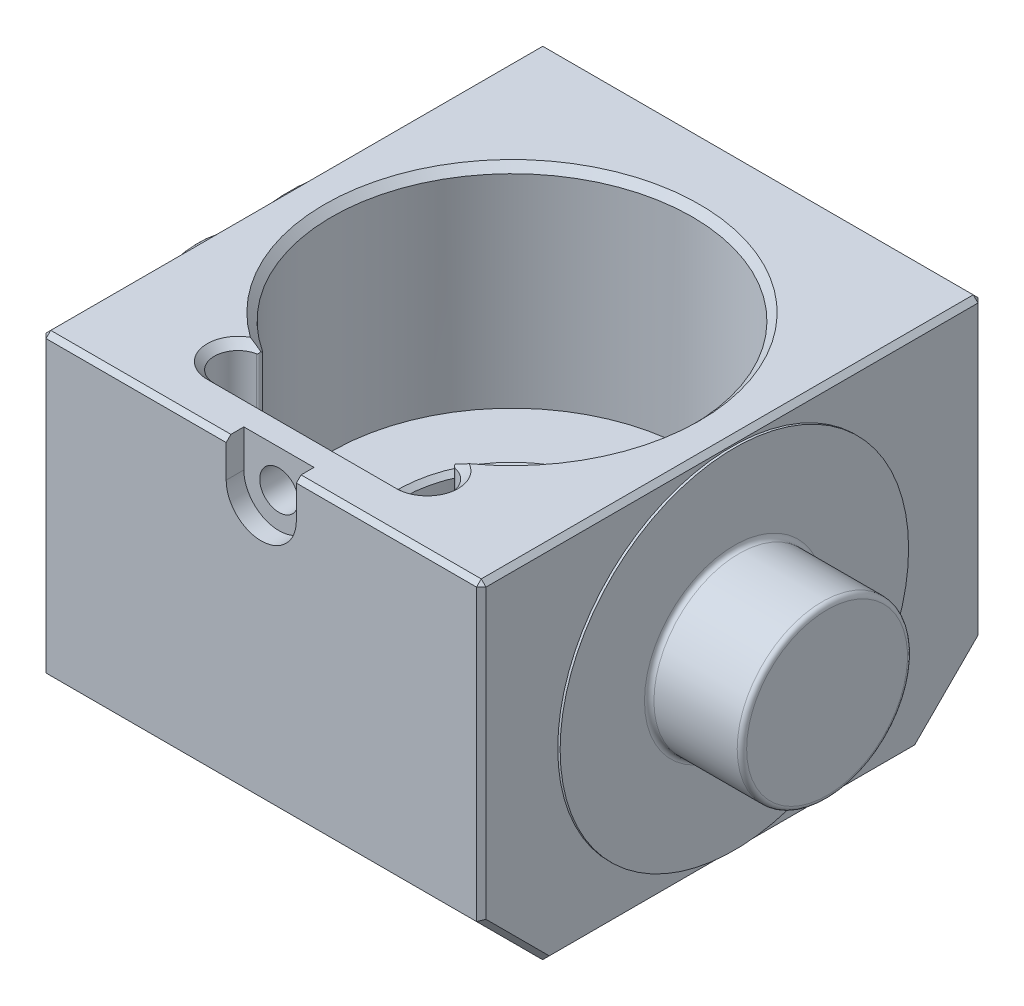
ISO-10303-21;
HEADER;
FILE_DESCRIPTION(('STEP AP214'),'2;1');
FILE_NAME('part.step','',(''),(''),'','','');
FILE_SCHEMA(('AUTOMOTIVE_DESIGN { 1 0 10303 214 1 1 1 1 }'));
ENDSEC;
DATA;
#1=APPLICATION_CONTEXT('core data for automotive mechanical design processes');
#2=APPLICATION_PROTOCOL_DEFINITION('international standard','automotive_design',2000,#1);
#3=PRODUCT_CONTEXT('',#1,'mechanical');
#4=PRODUCT('Part','Part','',(#3));
#5=PRODUCT_RELATED_PRODUCT_CATEGORY('part','',(#4));
#6=PRODUCT_DEFINITION_FORMATION('','',#4);
#7=PRODUCT_DEFINITION_CONTEXT('part definition',#1,'design');
#8=PRODUCT_DEFINITION('design','',#6,#7);
#9=PRODUCT_DEFINITION_SHAPE('','',#8);
#10=(LENGTH_UNIT() NAMED_UNIT(*) SI_UNIT(.MILLI.,.METRE.));
#11=(NAMED_UNIT(*) PLANE_ANGLE_UNIT() SI_UNIT($,.RADIAN.));
#12=(NAMED_UNIT(*) SI_UNIT($,.STERADIAN.) SOLID_ANGLE_UNIT());
#13=UNCERTAINTY_MEASURE_WITH_UNIT(LENGTH_MEASURE(1.E-05),#10,'distance_accuracy_value','');
#14=(GEOMETRIC_REPRESENTATION_CONTEXT(3) GLOBAL_UNCERTAINTY_ASSIGNED_CONTEXT((#13)) GLOBAL_UNIT_ASSIGNED_CONTEXT((#10,
#11,#12)) REPRESENTATION_CONTEXT('',''));
#15=CARTESIAN_POINT('',(0.,0.,0.));
#16=DIRECTION('',(0.,0.,1.));
#17=DIRECTION('',(1.,0.,0.));
#18=AXIS2_PLACEMENT_3D('',#15,#16,#17);
#19=CARTESIAN_POINT('',(23.25,18.55,26.5));
#20=DIRECTION('',(0.,-0.707106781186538,-0.707106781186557));
#21=DIRECTION('',(-1.,0.,0.));
#22=AXIS2_PLACEMENT_3D('',#19,#20,#21);
#23=PLANE('',#22);
#24=DIRECTION('',(0.,-0.707106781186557,0.707106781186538));
#25=VECTOR('',#24,1.);
#26=CARTESIAN_POINT('',(3.7084,18.55,26.5));
#27=LINE('',#26,#25);
#28=CARTESIAN_POINT('',(3.7084,18.55,26.5));
#29=VERTEX_POINT('',#28);
#30=CARTESIAN_POINT('',(3.7084,19.05,26.));
#31=VERTEX_POINT('',#30);
#32=EDGE_CURVE('E12',#29,#31,#27,.F.);
#33=ORIENTED_EDGE('',*,*,#32,.F.);
#34=DIRECTION('',(-1.,0.,0.));
#35=VECTOR('',#34,1.);
#36=CARTESIAN_POINT('',(23.25,18.55,26.5));
#37=LINE('',#36,#35);
#38=CARTESIAN_POINT('',(22.75,18.55,26.5));
#39=VERTEX_POINT('',#38);
#40=EDGE_CURVE('E322',#39,#29,#37,.T.);
#41=ORIENTED_EDGE('',*,*,#40,.F.);
#42=DIRECTION('',(0.,0.707106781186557,-0.707106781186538));
#43=VECTOR('',#42,1.);
#44=CARTESIAN_POINT('',(22.75,18.55,26.5));
#45=LINE('',#44,#43);
#46=CARTESIAN_POINT('',(22.75,19.05,26.));
#47=VERTEX_POINT('',#46);
#48=EDGE_CURVE('E384',#47,#39,#45,.F.);
#49=ORIENTED_EDGE('',*,*,#48,.F.);
#50=DIRECTION('',(1.,0.,0.));
#51=VECTOR('',#50,1.);
#52=CARTESIAN_POINT('',(23.25,19.05,26.));
#53=LINE('',#52,#51);
#54=EDGE_CURVE('E357',#31,#47,#53,.T.);
#55=ORIENTED_EDGE('',*,*,#54,.F.);
#56=EDGE_LOOP('',(#33,#41,#49,#55));
#57=FACE_BOUND('',#56,.T.);
#58=ADVANCED_FACE('F34',(#57),#23,.F.);
#59=CARTESIAN_POINT('',(0.,15.11,-26.501));
#60=DIRECTION('',(0.,0.,1.));
#61=DIRECTION('',(1.,0.,0.));
#62=AXIS2_PLACEMENT_3D('',#59,#60,#61);
#63=CYLINDRICAL_SURFACE('',#62,2.032);
#64=CARTESIAN_POINT('',(0.,15.11,21.45539));
#65=DIRECTION('',(0.,0.,1.));
#66=DIRECTION('',(1.,0.,0.));
#67=AXIS2_PLACEMENT_3D('',#64,#65,#66);
#68=CIRCLE('',#67,2.032);
#69=CARTESIAN_POINT('',(2.032,15.11,21.45539));
#70=VERTEX_POINT('',#69);
#71=EDGE_CURVE('E255',#70,#70,#68,.F.);
#72=CARTESIAN_POINT('',(0.,15.11,24.63039));
#73=DIRECTION('',(0.,0.,1.));
#74=DIRECTION('',(1.,0.,0.));
#75=AXIS2_PLACEMENT_3D('',#72,#73,#74);
#76=CIRCLE('',#75,2.032);
#77=CARTESIAN_POINT('',(2.032,15.11,24.63039));
#78=VERTEX_POINT('',#77);
#79=EDGE_CURVE('E247',#78,#78,#76,.F.);
#80=CARTESIAN_POINT('',(2.032,15.11,21.45539));
#81=CARTESIAN_POINT('',(2.032,15.11,21.4884629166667));
#82=CARTESIAN_POINT('',(2.032,15.11,21.5215358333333));
#83=CARTESIAN_POINT('',(2.032,15.11,21.5876816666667));
#84=CARTESIAN_POINT('',(2.032,15.11,21.6207545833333));
#85=CARTESIAN_POINT('',(2.032,15.11,21.6869004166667));
#86=CARTESIAN_POINT('',(2.032,15.11,21.7199733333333));
#87=CARTESIAN_POINT('',(2.032,15.11,21.7861191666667));
#88=CARTESIAN_POINT('',(2.032,15.11,21.8191920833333));
#89=CARTESIAN_POINT('',(2.032,15.11,21.8853379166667));
#90=CARTESIAN_POINT('',(2.032,15.11,21.9184108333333));
#91=CARTESIAN_POINT('',(2.032,15.11,21.9845566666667));
#92=CARTESIAN_POINT('',(2.032,15.11,22.0176295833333));
#93=CARTESIAN_POINT('',(2.032,15.11,22.0837754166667));
#94=CARTESIAN_POINT('',(2.032,15.11,22.1168483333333));
#95=CARTESIAN_POINT('',(2.032,15.11,22.1829941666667));
#96=CARTESIAN_POINT('',(2.032,15.11,22.2160670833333));
#97=CARTESIAN_POINT('',(2.032,15.11,22.2822129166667));
#98=CARTESIAN_POINT('',(2.032,15.11,22.3152858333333));
#99=CARTESIAN_POINT('',(2.032,15.11,22.3814316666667));
#100=CARTESIAN_POINT('',(2.032,15.11,22.4145045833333));
#101=CARTESIAN_POINT('',(2.032,15.11,22.4806504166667));
#102=CARTESIAN_POINT('',(2.032,15.11,22.5137233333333));
#103=CARTESIAN_POINT('',(2.032,15.11,22.5798691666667));
#104=CARTESIAN_POINT('',(2.032,15.11,22.6129420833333));
#105=CARTESIAN_POINT('',(2.032,15.11,22.6790879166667));
#106=CARTESIAN_POINT('',(2.032,15.11,22.7121608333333));
#107=CARTESIAN_POINT('',(2.032,15.11,22.7783066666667));
#108=CARTESIAN_POINT('',(2.032,15.11,22.8113795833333));
#109=CARTESIAN_POINT('',(2.032,15.11,22.8775254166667));
#110=CARTESIAN_POINT('',(2.032,15.11,22.9105983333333));
#111=CARTESIAN_POINT('',(2.032,15.11,22.9767441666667));
#112=CARTESIAN_POINT('',(2.032,15.11,23.0098170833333));
#113=CARTESIAN_POINT('',(2.032,15.11,23.0759629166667));
#114=CARTESIAN_POINT('',(2.032,15.11,23.1090358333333));
#115=CARTESIAN_POINT('',(2.032,15.11,23.1751816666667));
#116=CARTESIAN_POINT('',(2.032,15.11,23.2082545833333));
#117=CARTESIAN_POINT('',(2.032,15.11,23.2744004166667));
#118=CARTESIAN_POINT('',(2.032,15.11,23.3074733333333));
#119=CARTESIAN_POINT('',(2.032,15.11,23.3736191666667));
#120=CARTESIAN_POINT('',(2.032,15.11,23.4066920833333));
#121=CARTESIAN_POINT('',(2.032,15.11,23.4728379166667));
#122=CARTESIAN_POINT('',(2.032,15.11,23.5059108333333));
#123=CARTESIAN_POINT('',(2.032,15.11,23.5720566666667));
#124=CARTESIAN_POINT('',(2.032,15.11,23.6051295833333));
#125=CARTESIAN_POINT('',(2.032,15.11,23.6712754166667));
#126=CARTESIAN_POINT('',(2.032,15.11,23.7043483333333));
#127=CARTESIAN_POINT('',(2.032,15.11,23.7704941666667));
#128=CARTESIAN_POINT('',(2.032,15.11,23.8035670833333));
#129=CARTESIAN_POINT('',(2.032,15.11,23.8697129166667));
#130=CARTESIAN_POINT('',(2.032,15.11,23.9027858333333));
#131=CARTESIAN_POINT('',(2.032,15.11,23.9689316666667));
#132=CARTESIAN_POINT('',(2.032,15.11,24.0020045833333));
#133=CARTESIAN_POINT('',(2.032,15.11,24.0681504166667));
#134=CARTESIAN_POINT('',(2.032,15.11,24.1012233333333));
#135=CARTESIAN_POINT('',(2.032,15.11,24.1673691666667));
#136=CARTESIAN_POINT('',(2.032,15.11,24.2004420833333));
#137=CARTESIAN_POINT('',(2.032,15.11,24.2665879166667));
#138=CARTESIAN_POINT('',(2.032,15.11,24.2996608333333));
#139=CARTESIAN_POINT('',(2.032,15.11,24.3658066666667));
#140=CARTESIAN_POINT('',(2.032,15.11,24.3988795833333));
#141=CARTESIAN_POINT('',(2.032,15.11,24.4650254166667));
#142=CARTESIAN_POINT('',(2.032,15.11,24.4980983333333));
#143=CARTESIAN_POINT('',(2.032,15.11,24.5642441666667));
#144=CARTESIAN_POINT('',(2.032,15.11,24.5973170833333));
#145=CARTESIAN_POINT('',(2.032,15.11,24.63039));
#146=B_SPLINE_CURVE_WITH_KNOTS('',3,(#80,#81,#82,#83,#84,#85,#86,#87,#88,#89,#90,#91,#92,#93,
#94,#95,#96,#97,#98,#99,#100,#101,#102,#103,#104,#105,#106,#107,#108,#109,#110,#111,#112,#113,
#114,#115,#116,#117,#118,#119,#120,#121,#122,#123,#124,#125,#126,#127,#128,#129,#130,#131,#132,
#133,#134,#135,#136,#137,#138,#139,#140,#141,#142,#143,#144,#145),.UNSPECIFIED.,.F.,.F.,(4,2,2,
2,2,2,2,2,2,2,2,2,2,2,2,2,2,2,2,2,2,2,2,2,2,2,2,2,2,2,2,2,4),(0.,0.0992187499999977,
0.198437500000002,0.29765625,0.396874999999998,0.496093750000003,0.5953125,0.694531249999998,
0.793749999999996,0.892968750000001,0.992187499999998,1.09140625,1.190625,1.28984375,1.3890625,
1.48828125,1.5875,1.68671875,1.7859375,1.88515625,1.984375,2.08359375,2.1828125,2.28203125,
2.38125,2.48046875,2.5796875,2.67890624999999,2.778125,2.87734375,2.97656249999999,3.07578125,
3.175),.UNSPECIFIED.);
#147=EDGE_CURVE('BSEAM559',#70,#78,#146,.T.);
#148=ORIENTED_EDGE('',*,*,#71,.T.);
#149=ORIENTED_EDGE('',*,*,#79,.F.);
#150=ORIENTED_EDGE('',*,*,#147,.T.);
#151=ORIENTED_EDGE('',*,*,#147,.F.);
#152=EDGE_LOOP('',(#148,#150,#149,#151));
#153=FACE_BOUND('',#152,.T.);
#154=ADVANCED_FACE('F559',(#153),#63,.F.);
#155=CARTESIAN_POINT('',(-23.25,0.,0.));
#156=DIRECTION('',(1.,0.,0.));
#157=DIRECTION('',(0.,0.,-1.));
#158=AXIS2_PLACEMENT_3D('',#155,#156,#157);
#159=PLANE('',#158);
#160=DIRECTION('',(0.,0.707106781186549,0.707106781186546));
#161=VECTOR('',#160,1.);
#162=CARTESIAN_POINT('',(-23.25,-11.7114466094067,26.1464466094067));
#163=LINE('',#162,#161);
#164=CARTESIAN_POINT('',(-23.25,-18.55,19.3078932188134));
#165=VERTEX_POINT('',#164);
#166=CARTESIAN_POINT('',(-23.25,-11.8578932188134,26.));
#167=VERTEX_POINT('',#166);
#168=EDGE_CURVE('E350',#165,#167,#163,.T.);
#169=ORIENTED_EDGE('',*,*,#168,.T.);
#170=DIRECTION('',(0.,1.,0.));
#171=VECTOR('',#170,1.);
#172=CARTESIAN_POINT('',(-23.25,0.,26.));
#173=LINE('',#172,#171);
#174=CARTESIAN_POINT('',(-23.25,18.55,26.));
#175=VERTEX_POINT('',#174);
#176=EDGE_CURVE('E352',#167,#175,#173,.T.);
#177=ORIENTED_EDGE('',*,*,#176,.T.);
#178=DIRECTION('',(0.,0.,-1.));
#179=VECTOR('',#178,1.);
#180=CARTESIAN_POINT('',(-23.25,18.55,0.));
#181=LINE('',#180,#179);
#182=CARTESIAN_POINT('',(-23.25,18.55,-26.));
#183=VERTEX_POINT('',#182);
#184=EDGE_CURVE('E342',#175,#183,#181,.T.);
#185=ORIENTED_EDGE('',*,*,#184,.T.);
#186=DIRECTION('',(0.,-1.,0.));
#187=VECTOR('',#186,1.);
#188=CARTESIAN_POINT('',(-23.25,0.,-26.));
#189=LINE('',#188,#187);
#190=CARTESIAN_POINT('',(-23.25,-11.8578932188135,-26.));
#191=VERTEX_POINT('',#190);
#192=EDGE_CURVE('E344',#183,#191,#189,.T.);
#193=ORIENTED_EDGE('',*,*,#192,.T.);
#194=DIRECTION('',(0.,-0.707106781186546,0.707106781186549));
#195=VECTOR('',#194,1.);
#196=CARTESIAN_POINT('',(-23.25,-18.6964466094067,-19.1614466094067));
#197=LINE('',#196,#195);
#198=CARTESIAN_POINT('',(-23.25,-18.55,-19.3078932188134));
#199=VERTEX_POINT('',#198);
#200=EDGE_CURVE('E346',#191,#199,#197,.T.);
#201=ORIENTED_EDGE('',*,*,#200,.T.);
#202=DIRECTION('',(0.,0.,1.));
#203=VECTOR('',#202,1.);
#204=CARTESIAN_POINT('',(-23.25,-18.55,0.));
#205=LINE('',#204,#203);
#206=EDGE_CURVE('E348',#199,#165,#205,.T.);
#207=ORIENTED_EDGE('',*,*,#206,.T.);
#208=EDGE_LOOP('',(#169,#177,#185,#193,#201,#207));
#209=FACE_BOUND('',#208,.T.);
#210=CARTESIAN_POINT('',(-23.25,0.,0.));
#211=DIRECTION('',(1.,0.,0.));
#212=DIRECTION('',(0.,0.,-1.));
#213=AXIS2_PLACEMENT_3D('',#210,#211,#212);
#214=CIRCLE('',#213,18.415);
#215=CARTESIAN_POINT('',(-23.25,0.,-18.415));
#216=VERTEX_POINT('',#215);
#217=EDGE_CURVE('E286',#216,#216,#214,.F.);
#218=ORIENTED_EDGE('',*,*,#217,.F.);
#219=EDGE_LOOP('',(#218));
#220=FACE_BOUND('',#219,.T.);
#221=ADVANCED_FACE('F561',(#209,#220),#159,.F.);
#222=CARTESIAN_POINT('',(23.25,0.,0.));
#223=DIRECTION('',(1.,0.,0.));
#224=DIRECTION('',(0.,0.,-1.));
#225=AXIS2_PLACEMENT_3D('',#222,#223,#224);
#226=PLANE('',#225);
#227=DIRECTION('',(0.,-1.,0.));
#228=VECTOR('',#227,1.);
#229=CARTESIAN_POINT('',(23.25,-12.065,26.));
#230=LINE('',#229,#228);
#231=CARTESIAN_POINT('',(23.25,18.55,26.));
#232=VERTEX_POINT('',#231);
#233=CARTESIAN_POINT('',(23.25,-11.8578932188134,26.));
#234=VERTEX_POINT('',#233);
#235=EDGE_CURVE('E311',#232,#234,#230,.T.);
#236=ORIENTED_EDGE('',*,*,#235,.T.);
#237=DIRECTION('',(0.,-0.707106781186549,-0.707106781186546));
#238=VECTOR('',#237,1.);
#239=CARTESIAN_POINT('',(23.25,-18.9289466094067,18.9289466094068));
#240=LINE('',#239,#238);
#241=CARTESIAN_POINT('',(23.25,-18.55,19.3078932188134));
#242=VERTEX_POINT('',#241);
#243=EDGE_CURVE('E313',#234,#242,#240,.T.);
#244=ORIENTED_EDGE('',*,*,#243,.T.);
#245=DIRECTION('',(0.,0.,-1.));
#246=VECTOR('',#245,1.);
#247=CARTESIAN_POINT('',(23.25,-18.55,-19.515));
#248=LINE('',#247,#246);
#249=CARTESIAN_POINT('',(23.25,-18.55,-19.3078932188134));
#250=VERTEX_POINT('',#249);
#251=EDGE_CURVE('E309',#242,#250,#248,.T.);
#252=ORIENTED_EDGE('',*,*,#251,.T.);
#253=DIRECTION('',(0.,0.707106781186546,-0.707106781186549));
#254=VECTOR('',#253,1.);
#255=CARTESIAN_POINT('',(23.25,-18.9289466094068,-18.9289466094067));
#256=LINE('',#255,#254);
#257=CARTESIAN_POINT('',(23.25,-11.8578932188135,-26.));
#258=VERTEX_POINT('',#257);
#259=EDGE_CURVE('E307',#250,#258,#256,.T.);
#260=ORIENTED_EDGE('',*,*,#259,.T.);
#261=DIRECTION('',(0.,1.,0.));
#262=VECTOR('',#261,1.);
#263=CARTESIAN_POINT('',(23.25,19.05,-26.));
#264=LINE('',#263,#262);
#265=CARTESIAN_POINT('',(23.25,18.55,-26.));
#266=VERTEX_POINT('',#265);
#267=EDGE_CURVE('E305',#258,#266,#264,.T.);
#268=ORIENTED_EDGE('',*,*,#267,.T.);
#269=DIRECTION('',(0.,0.,1.));
#270=VECTOR('',#269,1.);
#271=CARTESIAN_POINT('',(23.25,18.55,26.5));
#272=LINE('',#271,#270);
#273=EDGE_CURVE('E303',#266,#232,#272,.T.);
#274=ORIENTED_EDGE('',*,*,#273,.T.);
#275=EDGE_LOOP('',(#236,#244,#252,#260,#268,#274));
#276=FACE_BOUND('',#275,.T.);
#277=CARTESIAN_POINT('',(23.25,0.,0.));
#278=DIRECTION('',(-1.,0.,0.));
#279=DIRECTION('',(0.,0.,1.));
#280=AXIS2_PLACEMENT_3D('',#277,#278,#279);
#281=CIRCLE('',#280,18.415);
#282=CARTESIAN_POINT('',(23.25,0.,18.415));
#283=VERTEX_POINT('',#282);
#284=EDGE_CURVE('E283',#283,#283,#281,.T.);
#285=ORIENTED_EDGE('',*,*,#284,.T.);
#286=EDGE_LOOP('',(#285));
#287=FACE_BOUND('',#286,.T.);
#288=ADVANCED_FACE('F568',(#276,#287),#226,.T.);
#289=CARTESIAN_POINT('',(23.25,19.05,-26.5));
#290=DIRECTION('',(0.,0.,1.));
#291=DIRECTION('',(0.,-1.,0.));
#292=AXIS2_PLACEMENT_3D('',#289,#290,#291);
#293=PLANE('',#292);
#294=DIRECTION('',(1.,0.,0.));
#295=VECTOR('',#294,1.);
#296=CARTESIAN_POINT('',(23.25,18.55,-26.5));
#297=LINE('',#296,#295);
#298=CARTESIAN_POINT('',(-22.75,18.55,-26.5));
#299=VERTEX_POINT('',#298);
#300=CARTESIAN_POINT('',(22.75,18.55,-26.5));
#301=VERTEX_POINT('',#300);
#302=EDGE_CURVE('E336',#299,#301,#297,.T.);
#303=ORIENTED_EDGE('',*,*,#302,.T.);
#304=DIRECTION('',(0.,-1.,0.));
#305=VECTOR('',#304,1.);
#306=CARTESIAN_POINT('',(22.75,-12.065,-26.5));
#307=LINE('',#306,#305);
#308=CARTESIAN_POINT('',(22.75,-12.065,-26.5));
#309=VERTEX_POINT('',#308);
#310=EDGE_CURVE('E340',#301,#309,#307,.T.);
#311=ORIENTED_EDGE('',*,*,#310,.T.);
#312=DIRECTION('',(-1.,0.,0.));
#313=VECTOR('',#312,1.);
#314=CARTESIAN_POINT('',(23.25,-12.065,-26.5));
#315=LINE('',#314,#313);
#316=CARTESIAN_POINT('',(-22.75,-12.065,-26.5));
#317=VERTEX_POINT('',#316);
#318=EDGE_CURVE('E291',#309,#317,#315,.T.);
#319=ORIENTED_EDGE('',*,*,#318,.T.);
#320=DIRECTION('',(0.,1.,0.));
#321=VECTOR('',#320,1.);
#322=CARTESIAN_POINT('',(-22.75,19.05,-26.5));
#323=LINE('',#322,#321);
#324=EDGE_CURVE('E338',#317,#299,#323,.T.);
#325=ORIENTED_EDGE('',*,*,#324,.T.);
#326=EDGE_LOOP('',(#303,#311,#319,#325));
#327=FACE_BOUND('',#326,.T.);
#328=ADVANCED_FACE('F639',(#327),#293,.F.);
#329=CARTESIAN_POINT('',(23.25,19.05,26.5));
#330=DIRECTION('',(0.,-1.,0.));
#331=DIRECTION('',(0.,0.,-1.));
#332=AXIS2_PLACEMENT_3D('',#329,#330,#331);
#333=PLANE('',#332);
#334=CARTESIAN_POINT('',(10.,19.05,18.95539));
#335=DIRECTION('',(0.,-1.,0.));
#336=DIRECTION('',(0.,0.,-1.));
#337=AXIS2_PLACEMENT_3D('',#334,#335,#336);
#338=CIRCLE('',#337,3.26200000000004);
#339=CARTESIAN_POINT('',(11.5630843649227,19.05,16.0922778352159));
#340=VERTEX_POINT('',#339);
#341=CARTESIAN_POINT('',(10.,19.05,22.21739));
#342=VERTEX_POINT('',#341);
#343=EDGE_CURVE('E431',#340,#342,#338,.T.);
#344=ORIENTED_EDGE('',*,*,#343,.T.);
#345=DIRECTION('',(-1.,0.,0.));
#346=VECTOR('',#345,1.);
#347=CARTESIAN_POINT('',(23.25,19.05,22.21739));
#348=LINE('',#347,#346);
#349=CARTESIAN_POINT('',(-10.,19.05,22.21739));
#350=VERTEX_POINT('',#349);
#351=EDGE_CURVE('E433',#342,#350,#348,.T.);
#352=ORIENTED_EDGE('',*,*,#351,.T.);
#353=CARTESIAN_POINT('',(-10.,19.05,18.95539));
#354=DIRECTION('',(0.,-1.,0.));
#355=DIRECTION('',(0.,0.,-1.));
#356=AXIS2_PLACEMENT_3D('',#353,#354,#355);
#357=CIRCLE('',#356,3.26200000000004);
#358=CARTESIAN_POINT('',(-11.5630843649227,19.05,16.0922778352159));
#359=VERTEX_POINT('',#358);
#360=EDGE_CURVE('E426',#350,#359,#357,.T.);
#361=ORIENTED_EDGE('',*,*,#360,.T.);
#362=CARTESIAN_POINT('',(0.,19.05,0.));
#363=DIRECTION('',(0.,-1.,0.));
#364=DIRECTION('',(0.,0.,-1.));
#365=AXIS2_PLACEMENT_3D('',#362,#363,#364);
#366=CIRCLE('',#365,19.81581);
#367=EDGE_CURVE('E429',#359,#340,#366,.T.);
#368=ORIENTED_EDGE('',*,*,#367,.T.);
#369=EDGE_LOOP('',(#344,#352,#361,#368));
#370=FACE_BOUND('',#369,.T.);
#371=DIRECTION('',(-1.,0.,0.));
#372=VECTOR('',#371,1.);
#373=CARTESIAN_POINT('',(23.25,19.05,24.63039));
#374=LINE('',#373,#372);
#375=CARTESIAN_POINT('',(3.7084,19.05,24.63039));
#376=VERTEX_POINT('',#375);
#377=CARTESIAN_POINT('',(-3.7084,19.05,24.63039));
#378=VERTEX_POINT('',#377);
#379=EDGE_CURVE('E249',#376,#378,#374,.T.);
#380=ORIENTED_EDGE('',*,*,#379,.F.);
#381=DIRECTION('',(0.,0.,1.));
#382=VECTOR('',#381,1.);
#383=CARTESIAN_POINT('',(3.7084,19.05,26.5));
#384=LINE('',#383,#382);
#385=EDGE_CURVE('E252',#376,#31,#384,.T.);
#386=ORIENTED_EDGE('',*,*,#385,.T.);
#387=ORIENTED_EDGE('',*,*,#54,.T.);
#388=DIRECTION('',(0.,0.,-1.));
#389=VECTOR('',#388,1.);
#390=CARTESIAN_POINT('',(22.75,19.05,-26.5));
#391=LINE('',#390,#389);
#392=CARTESIAN_POINT('',(22.75,19.05,-26.));
#393=VERTEX_POINT('',#392);
#394=EDGE_CURVE('E361',#47,#393,#391,.T.);
#395=ORIENTED_EDGE('',*,*,#394,.T.);
#396=DIRECTION('',(-1.,0.,0.));
#397=VECTOR('',#396,1.);
#398=CARTESIAN_POINT('',(23.25,19.05,-26.));
#399=LINE('',#398,#397);
#400=CARTESIAN_POINT('',(-22.75,19.05,-26.));
#401=VERTEX_POINT('',#400);
#402=EDGE_CURVE('E363',#393,#401,#399,.T.);
#403=ORIENTED_EDGE('',*,*,#402,.T.);
#404=DIRECTION('',(0.,0.,1.));
#405=VECTOR('',#404,1.);
#406=CARTESIAN_POINT('',(-22.75,19.05,26.5));
#407=LINE('',#406,#405);
#408=CARTESIAN_POINT('',(-22.75,19.05,26.));
#409=VERTEX_POINT('',#408);
#410=EDGE_CURVE('E355',#401,#409,#407,.T.);
#411=ORIENTED_EDGE('',*,*,#410,.T.);
#412=CARTESIAN_POINT('',(-3.7084,19.05,26.));
#413=VERTEX_POINT('',#412);
#414=EDGE_CURVE('E358',#409,#413,#53,.T.);
#415=ORIENTED_EDGE('',*,*,#414,.T.);
#416=DIRECTION('',(0.,0.,-1.));
#417=VECTOR('',#416,1.);
#418=CARTESIAN_POINT('',(-3.7084,19.05,26.5));
#419=LINE('',#418,#417);
#420=EDGE_CURVE('E49',#413,#378,#419,.T.);
#421=ORIENTED_EDGE('',*,*,#420,.T.);
#422=EDGE_LOOP('',(#380,#386,#387,#395,#403,#411,#415,#421));
#423=FACE_BOUND('',#422,.T.);
#424=ADVANCED_FACE('F647',(#370,#423),#333,.F.);
#425=CARTESIAN_POINT('',(23.25,19.05,26.5));
#426=DIRECTION('',(0.,0.,-1.));
#427=DIRECTION('',(0.,1.,0.));
#428=AXIS2_PLACEMENT_3D('',#425,#426,#427);
#429=PLANE('',#428);
#430=ORIENTED_EDGE('',*,*,#40,.T.);
#431=DIRECTION('',(0.,1.,0.));
#432=VECTOR('',#431,1.);
#433=CARTESIAN_POINT('',(3.7084,22.99,26.5));
#434=LINE('',#433,#432);
#435=CARTESIAN_POINT('',(3.7084,15.11,26.5));
#436=VERTEX_POINT('',#435);
#437=EDGE_CURVE('E236',#436,#29,#434,.T.);
#438=ORIENTED_EDGE('',*,*,#437,.F.);
#439=CARTESIAN_POINT('',(0.,15.11,26.5));
#440=DIRECTION('',(0.,0.,1.));
#441=DIRECTION('',(1.,0.,0.));
#442=AXIS2_PLACEMENT_3D('',#439,#440,#441);
#443=CIRCLE('',#442,3.7084);
#444=CARTESIAN_POINT('',(-3.7084,15.11,26.5));
#445=VERTEX_POINT('',#444);
#446=EDGE_CURVE('E226',#445,#436,#443,.T.);
#447=ORIENTED_EDGE('',*,*,#446,.F.);
#448=DIRECTION('',(0.,-1.,0.));
#449=VECTOR('',#448,1.);
#450=CARTESIAN_POINT('',(-3.7084,22.99,26.5));
#451=LINE('',#450,#449);
#452=CARTESIAN_POINT('',(-3.7084,18.55,26.5));
#453=VERTEX_POINT('',#452);
#454=EDGE_CURVE('E218',#453,#445,#451,.T.);
#455=ORIENTED_EDGE('',*,*,#454,.F.);
#456=CARTESIAN_POINT('',(-22.75,18.55,26.5));
#457=VERTEX_POINT('',#456);
#458=EDGE_CURVE('E321',#453,#457,#37,.T.);
#459=ORIENTED_EDGE('',*,*,#458,.T.);
#460=DIRECTION('',(0.,-1.,0.));
#461=VECTOR('',#460,1.);
#462=CARTESIAN_POINT('',(-22.75,19.05,26.5));
#463=LINE('',#462,#461);
#464=CARTESIAN_POINT('',(-22.75,-12.065,26.5));
#465=VERTEX_POINT('',#464);
#466=EDGE_CURVE('E324',#457,#465,#463,.T.);
#467=ORIENTED_EDGE('',*,*,#466,.T.);
#468=DIRECTION('',(1.,0.,0.));
#469=VECTOR('',#468,1.);
#470=CARTESIAN_POINT('',(23.25,-12.065,26.5));
#471=LINE('',#470,#469);
#472=CARTESIAN_POINT('',(22.75,-12.065,26.5));
#473=VERTEX_POINT('',#472);
#474=EDGE_CURVE('E300',#465,#473,#471,.T.);
#475=ORIENTED_EDGE('',*,*,#474,.T.);
#476=DIRECTION('',(0.,1.,0.));
#477=VECTOR('',#476,1.);
#478=CARTESIAN_POINT('',(22.75,19.05,26.5));
#479=LINE('',#478,#477);
#480=EDGE_CURVE('E326',#473,#39,#479,.T.);
#481=ORIENTED_EDGE('',*,*,#480,.T.);
#482=EDGE_LOOP('',(#430,#438,#447,#455,#459,#467,#475,#481));
#483=FACE_BOUND('',#482,.T.);
#484=ADVANCED_FACE('F239',(#483),#429,.F.);
#485=CARTESIAN_POINT('',(23.25,-19.05,26.5));
#486=DIRECTION('',(0.,1.,0.));
#487=DIRECTION('',(0.,0.,1.));
#488=AXIS2_PLACEMENT_3D('',#485,#486,#487);
#489=PLANE('',#488);
#490=CARTESIAN_POINT('',(0.,-19.05,0.));
#491=DIRECTION('',(0.,1.,0.));
#492=DIRECTION('',(0.,0.,1.));
#493=AXIS2_PLACEMENT_3D('',#490,#491,#492);
#494=CIRCLE('',#493,12.057);
#495=CARTESIAN_POINT('',(0.,-19.05,12.057));
#496=VERTEX_POINT('',#495);
#497=EDGE_CURVE('E526',#496,#496,#494,.T.);
#498=ORIENTED_EDGE('',*,*,#497,.T.);
#499=EDGE_LOOP('',(#498));
#500=FACE_BOUND('',#499,.T.);
#501=DIRECTION('',(1.,0.,0.));
#502=VECTOR('',#501,1.);
#503=CARTESIAN_POINT('',(23.25,-19.05,-19.515));
#504=LINE('',#503,#502);
#505=CARTESIAN_POINT('',(-22.75,-19.05,-19.515));
#506=VERTEX_POINT('',#505);
#507=CARTESIAN_POINT('',(22.75,-19.05,-19.515));
#508=VERTEX_POINT('',#507);
#509=EDGE_CURVE('E297',#506,#508,#504,.T.);
#510=ORIENTED_EDGE('',*,*,#509,.T.);
#511=DIRECTION('',(0.,0.,1.));
#512=VECTOR('',#511,1.);
#513=CARTESIAN_POINT('',(22.75,-19.05,19.515));
#514=LINE('',#513,#512);
#515=CARTESIAN_POINT('',(22.75,-19.05,19.515));
#516=VERTEX_POINT('',#515);
#517=EDGE_CURVE('E330',#508,#516,#514,.T.);
#518=ORIENTED_EDGE('',*,*,#517,.T.);
#519=DIRECTION('',(-1.,0.,0.));
#520=VECTOR('',#519,1.);
#521=CARTESIAN_POINT('',(23.25,-19.05,19.515));
#522=LINE('',#521,#520);
#523=CARTESIAN_POINT('',(-22.75,-19.05,19.515));
#524=VERTEX_POINT('',#523);
#525=EDGE_CURVE('E294',#516,#524,#522,.T.);
#526=ORIENTED_EDGE('',*,*,#525,.T.);
#527=DIRECTION('',(0.,0.,-1.));
#528=VECTOR('',#527,1.);
#529=CARTESIAN_POINT('',(-22.75,-19.05,26.5));
#530=LINE('',#529,#528);
#531=EDGE_CURVE('E328',#524,#506,#530,.T.);
#532=ORIENTED_EDGE('',*,*,#531,.T.);
#533=EDGE_LOOP('',(#510,#518,#526,#532));
#534=FACE_BOUND('',#533,.T.);
#535=ADVANCED_FACE('F636',(#500,#534),#489,.F.);
#536=CARTESIAN_POINT('',(0.,0.,0.));
#537=DIRECTION('',(-1.,0.,0.));
#538=DIRECTION('',(0.,0.,1.));
#539=AXIS2_PLACEMENT_3D('',#536,#537,#538);
#540=CYLINDRICAL_SURFACE('',#539,18.415);
#541=ORIENTED_EDGE('',*,*,#284,.F.);
#542=EDGE_LOOP('',(#541));
#543=FACE_BOUND('',#542,.T.);
#544=CARTESIAN_POINT('',(23.5,0.,0.));
#545=DIRECTION('',(-1.,0.,0.));
#546=DIRECTION('',(0.,0.,1.));
#547=AXIS2_PLACEMENT_3D('',#544,#545,#546);
#548=CIRCLE('',#547,18.415);
#549=CARTESIAN_POINT('',(23.5,0.,18.415));
#550=VERTEX_POINT('',#549);
#551=EDGE_CURVE('E280',#550,#550,#548,.T.);
#552=ORIENTED_EDGE('',*,*,#551,.T.);
#553=EDGE_LOOP('',(#552));
#554=FACE_BOUND('',#553,.T.);
#555=ADVANCED_FACE('F632',(#543,#554),#540,.T.);
#556=CARTESIAN_POINT('',(23.5,18.415,0.));
#557=DIRECTION('',(-1.,0.,0.));
#558=DIRECTION('',(0.,0.,1.));
#559=AXIS2_PLACEMENT_3D('',#556,#557,#558);
#560=PLANE('',#559);
#561=CARTESIAN_POINT('',(23.5,0.,0.));
#562=DIRECTION('',(-1.,0.,0.));
#563=DIRECTION('',(0.,0.,1.));
#564=AXIS2_PLACEMENT_3D('',#561,#562,#563);
#565=CIRCLE('',#564,9.500000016);
#566=CARTESIAN_POINT('',(23.5,0.,9.500000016));
#567=VERTEX_POINT('',#566);
#568=EDGE_CURVE('E541',#567,#567,#565,.T.);
#569=ORIENTED_EDGE('',*,*,#568,.T.);
#570=EDGE_LOOP('',(#569));
#571=FACE_BOUND('',#570,.T.);
#572=ORIENTED_EDGE('',*,*,#551,.F.);
#573=EDGE_LOOP('',(#572));
#574=FACE_BOUND('',#573,.T.);
#575=ADVANCED_FACE('F628',(#571,#574),#560,.F.);
#576=CARTESIAN_POINT('',(0.,0.,0.));
#577=DIRECTION('',(-1.,0.,0.));
#578=DIRECTION('',(0.,0.,1.));
#579=AXIS2_PLACEMENT_3D('',#576,#577,#578);
#580=CYLINDRICAL_SURFACE('',#579,9.);
#581=CARTESIAN_POINT('',(24.000000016,0.,0.));
#582=DIRECTION('',(-1.,0.,0.));
#583=DIRECTION('',(0.,0.,1.));
#584=AXIS2_PLACEMENT_3D('',#581,#582,#583);
#585=CIRCLE('',#584,9.);
#586=CARTESIAN_POINT('',(24.000000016,0.,9.));
#587=VERTEX_POINT('',#586);
#588=EDGE_CURVE('E544',#587,#587,#585,.F.);
#589=ORIENTED_EDGE('',*,*,#588,.T.);
#590=EDGE_LOOP('',(#589));
#591=FACE_BOUND('',#590,.T.);
#592=CARTESIAN_POINT('',(32.799999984,0.,0.));
#593=DIRECTION('',(-1.,0.,0.));
#594=DIRECTION('',(0.,0.,1.));
#595=AXIS2_PLACEMENT_3D('',#592,#593,#594);
#596=CIRCLE('',#595,9.);
#597=CARTESIAN_POINT('',(32.799999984,0.,9.));
#598=VERTEX_POINT('',#597);
#599=EDGE_CURVE('E535',#598,#598,#596,.T.);
#600=ORIENTED_EDGE('',*,*,#599,.T.);
#601=EDGE_LOOP('',(#600));
#602=FACE_BOUND('',#601,.T.);
#603=ADVANCED_FACE('F624',(#591,#602),#580,.T.);
#604=CARTESIAN_POINT('',(33.3,9.,0.));
#605=DIRECTION('',(-1.,0.,0.));
#606=DIRECTION('',(0.,0.,1.));
#607=AXIS2_PLACEMENT_3D('',#604,#605,#606);
#608=PLANE('',#607);
#609=CARTESIAN_POINT('',(33.3,0.,0.));
#610=DIRECTION('',(-1.,0.,0.));
#611=DIRECTION('',(0.,0.,1.));
#612=AXIS2_PLACEMENT_3D('',#609,#610,#611);
#613=CIRCLE('',#612,8.499999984);
#614=CARTESIAN_POINT('',(33.3,0.,8.499999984));
#615=VERTEX_POINT('',#614);
#616=EDGE_CURVE('E538',#615,#615,#613,.F.);
#617=ORIENTED_EDGE('',*,*,#616,.T.);
#618=EDGE_LOOP('',(#617));
#619=FACE_BOUND('',#618,.T.);
#620=ADVANCED_FACE('F620',(#619),#608,.F.);
#621=CARTESIAN_POINT('',(0.,0.,0.));
#622=DIRECTION('',(1.,0.,0.));
#623=DIRECTION('',(0.,0.,1.));
#624=AXIS2_PLACEMENT_3D('',#621,#622,#623);
#625=CYLINDRICAL_SURFACE('',#624,18.415);
#626=ORIENTED_EDGE('',*,*,#217,.T.);
#627=EDGE_LOOP('',(#626));
#628=FACE_BOUND('',#627,.T.);
#629=CARTESIAN_POINT('',(-23.5,0.,0.));
#630=DIRECTION('',(-1.,0.,0.));
#631=DIRECTION('',(0.,0.,1.));
#632=AXIS2_PLACEMENT_3D('',#629,#630,#631);
#633=CIRCLE('',#632,18.415);
#634=CARTESIAN_POINT('',(-23.5,0.,18.415));
#635=VERTEX_POINT('',#634);
#636=EDGE_CURVE('E277',#635,#635,#633,.T.);
#637=ORIENTED_EDGE('',*,*,#636,.F.);
#638=EDGE_LOOP('',(#637));
#639=FACE_BOUND('',#638,.T.);
#640=ADVANCED_FACE('F616',(#628,#639),#625,.T.);
#641=CARTESIAN_POINT('',(-23.5,18.415,0.));
#642=DIRECTION('',(1.,0.,0.));
#643=DIRECTION('',(0.,0.,1.));
#644=AXIS2_PLACEMENT_3D('',#641,#642,#643);
#645=PLANE('',#644);
#646=CARTESIAN_POINT('',(-23.5,0.,0.));
#647=DIRECTION('',(1.,0.,0.));
#648=DIRECTION('',(0.,0.,-1.));
#649=AXIS2_PLACEMENT_3D('',#646,#647,#648);
#650=CIRCLE('',#649,9.500000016);
#651=CARTESIAN_POINT('',(-23.5,0.,-9.500000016));
#652=VERTEX_POINT('',#651);
#653=EDGE_CURVE('E550',#652,#652,#650,.T.);
#654=ORIENTED_EDGE('',*,*,#653,.T.);
#655=EDGE_LOOP('',(#654));
#656=FACE_BOUND('',#655,.T.);
#657=ORIENTED_EDGE('',*,*,#636,.T.);
#658=EDGE_LOOP('',(#657));
#659=FACE_BOUND('',#658,.T.);
#660=ADVANCED_FACE('F612',(#656,#659),#645,.F.);
#661=CARTESIAN_POINT('',(0.,0.,0.));
#662=DIRECTION('',(1.,0.,0.));
#663=DIRECTION('',(0.,0.,1.));
#664=AXIS2_PLACEMENT_3D('',#661,#662,#663);
#665=CYLINDRICAL_SURFACE('',#664,9.);
#666=CARTESIAN_POINT('',(-24.000000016,0.,0.));
#667=DIRECTION('',(1.,0.,0.));
#668=DIRECTION('',(0.,0.,-1.));
#669=AXIS2_PLACEMENT_3D('',#666,#667,#668);
#670=CIRCLE('',#669,9.);
#671=CARTESIAN_POINT('',(-24.000000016,0.,-9.));
#672=VERTEX_POINT('',#671);
#673=EDGE_CURVE('E547',#672,#672,#670,.F.);
#674=ORIENTED_EDGE('',*,*,#673,.T.);
#675=EDGE_LOOP('',(#674));
#676=FACE_BOUND('',#675,.T.);
#677=CARTESIAN_POINT('',(-32.799999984,0.,0.));
#678=DIRECTION('',(1.,0.,0.));
#679=DIRECTION('',(0.,0.,-1.));
#680=AXIS2_PLACEMENT_3D('',#677,#678,#679);
#681=CIRCLE('',#680,9.);
#682=CARTESIAN_POINT('',(-32.799999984,0.,-9.));
#683=VERTEX_POINT('',#682);
#684=EDGE_CURVE('E532',#683,#683,#681,.T.);
#685=ORIENTED_EDGE('',*,*,#684,.T.);
#686=EDGE_LOOP('',(#685));
#687=FACE_BOUND('',#686,.T.);
#688=ADVANCED_FACE('F608',(#676,#687),#665,.T.);
#689=CARTESIAN_POINT('',(-33.3,9.,0.));
#690=DIRECTION('',(1.,0.,0.));
#691=DIRECTION('',(0.,0.,1.));
#692=AXIS2_PLACEMENT_3D('',#689,#690,#691);
#693=PLANE('',#692);
#694=CARTESIAN_POINT('',(-33.3,0.,0.));
#695=DIRECTION('',(1.,0.,0.));
#696=DIRECTION('',(0.,0.,-1.));
#697=AXIS2_PLACEMENT_3D('',#694,#695,#696);
#698=CIRCLE('',#697,8.499999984);
#699=CARTESIAN_POINT('',(-33.3,0.,-8.499999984));
#700=VERTEX_POINT('',#699);
#701=EDGE_CURVE('E529',#700,#700,#698,.F.);
#702=ORIENTED_EDGE('',*,*,#701,.T.);
#703=EDGE_LOOP('',(#702));
#704=FACE_BOUND('',#703,.T.);
#705=ADVANCED_FACE('F604',(#704),#693,.F.);
#706=CARTESIAN_POINT('',(0.,-3.175,0.));
#707=DIRECTION('',(0.,-1.,0.));
#708=DIRECTION('',(0.,0.,-1.));
#709=AXIS2_PLACEMENT_3D('',#706,#707,#708);
#710=PLANE('',#709);
#711=CARTESIAN_POINT('',(0.,-3.175,0.));
#712=DIRECTION('',(0.,-1.,0.));
#713=DIRECTION('',(0.,0.,-1.));
#714=AXIS2_PLACEMENT_3D('',#711,#712,#713);
#715=CIRCLE('',#714,12.057);
#716=CARTESIAN_POINT('',(0.,-3.175,-12.057));
#717=VERTEX_POINT('',#716);
#718=EDGE_CURVE('E523',#717,#717,#715,.T.);
#719=ORIENTED_EDGE('',*,*,#718,.T.);
#720=EDGE_LOOP('',(#719));
#721=FACE_BOUND('',#720,.T.);
#722=CARTESIAN_POINT('',(0.,-3.175,0.));
#723=DIRECTION('',(0.,1.,0.));
#724=DIRECTION('',(0.,0.,1.));
#725=AXIS2_PLACEMENT_3D('',#722,#723,#724);
#726=CIRCLE('',#725,19.05381);
#727=CARTESIAN_POINT('',(0.,-3.175,19.05381));
#728=VERTEX_POINT('',#727);
#729=EDGE_CURVE('E272',#728,#728,#726,.T.);
#730=ORIENTED_EDGE('',*,*,#729,.T.);
#731=EDGE_LOOP('',(#730));
#732=FACE_BOUND('',#731,.T.);
#733=ADVANCED_FACE('F600',(#721,#732),#710,.F.);
#734=CARTESIAN_POINT('',(0.,10.1246822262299,0.));
#735=DIRECTION('',(0.,1.,0.));
#736=DIRECTION('',(0.,0.,1.));
#737=AXIS2_PLACEMENT_3D('',#734,#735,#736);
#738=CYLINDRICAL_SURFACE('',#737,19.05381);
#739=CARTESIAN_POINT('',(0.,12.55,0.));
#740=DIRECTION('',(0.,1.,0.));
#741=DIRECTION('',(0.,0.,1.));
#742=AXIS2_PLACEMENT_3D('',#739,#740,#741);
#743=CIRCLE('',#742,19.05381);
#744=CARTESIAN_POINT('',(10.4044098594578,12.55,15.9623284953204));
#745=VERTEX_POINT('',#744);
#746=CARTESIAN_POINT('',(-10.4044098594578,12.55,15.9623284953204));
#747=VERTEX_POINT('',#746);
#748=EDGE_CURVE('E289',#745,#747,#743,.F.);
#749=ORIENTED_EDGE('',*,*,#748,.F.);
#750=DIRECTION('',(0.,1.,0.));
#751=VECTOR('',#750,1.);
#752=CARTESIAN_POINT('',(10.4044098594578,10.1246822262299,15.9623284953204));
#753=LINE('',#752,#751);
#754=CARTESIAN_POINT('',(10.4044098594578,18.288,15.9623284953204));
#755=VERTEX_POINT('',#754);
#756=EDGE_CURVE('E761',#745,#755,#753,.T.);
#757=ORIENTED_EDGE('',*,*,#756,.T.);
#758=CARTESIAN_POINT('',(0.,18.288,0.));
#759=DIRECTION('',(0.,-1.,0.));
#760=DIRECTION('',(0.,0.,-1.));
#761=AXIS2_PLACEMENT_3D('',#758,#759,#760);
#762=CIRCLE('',#761,19.05381);
#763=CARTESIAN_POINT('',(-10.4044098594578,18.288,15.9623284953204));
#764=VERTEX_POINT('',#763);
#765=EDGE_CURVE('E439',#755,#764,#762,.F.);
#766=ORIENTED_EDGE('',*,*,#765,.T.);
#767=DIRECTION('',(0.,1.,0.));
#768=VECTOR('',#767,1.);
#769=CARTESIAN_POINT('',(-10.4044098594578,10.1246822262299,15.9623284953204));
#770=LINE('',#769,#768);
#771=EDGE_CURVE('E444',#764,#747,#770,.F.);
#772=ORIENTED_EDGE('',*,*,#771,.T.);
#773=EDGE_LOOP('',(#749,#757,#766,#772));
#774=FACE_BOUND('',#773,.T.);
#775=ORIENTED_EDGE('',*,*,#729,.F.);
#776=EDGE_LOOP('',(#775));
#777=FACE_BOUND('',#776,.T.);
#778=ADVANCED_FACE('F596',(#774,#777),#738,.F.);
#779=CARTESIAN_POINT('',(0.,-1.92521317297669,0.));
#780=DIRECTION('',(0.,1.,0.));
#781=DIRECTION('',(0.,0.,1.));
#782=AXIS2_PLACEMENT_3D('',#779,#780,#781);
#783=CYLINDRICAL_SURFACE('',#782,11.557);
#784=CARTESIAN_POINT('',(0.,-3.675,0.));
#785=DIRECTION('',(0.,-1.,0.));
#786=DIRECTION('',(0.,0.,-1.));
#787=AXIS2_PLACEMENT_3D('',#784,#785,#786);
#788=CIRCLE('',#787,11.557);
#789=CARTESIAN_POINT('',(0.,-3.675,-11.557));
#790=VERTEX_POINT('',#789);
#791=EDGE_CURVE('E520',#790,#790,#788,.F.);
#792=ORIENTED_EDGE('',*,*,#791,.T.);
#793=EDGE_LOOP('',(#792));
#794=FACE_BOUND('',#793,.T.);
#795=CARTESIAN_POINT('',(0.,-18.55,0.));
#796=DIRECTION('',(0.,1.,0.));
#797=DIRECTION('',(0.,0.,1.));
#798=AXIS2_PLACEMENT_3D('',#795,#796,#797);
#799=CIRCLE('',#798,11.557);
#800=CARTESIAN_POINT('',(0.,-18.55,11.557));
#801=VERTEX_POINT('',#800);
#802=EDGE_CURVE('E517',#801,#801,#799,.F.);
#803=ORIENTED_EDGE('',*,*,#802,.T.);
#804=EDGE_LOOP('',(#803));
#805=FACE_BOUND('',#804,.T.);
#806=ADVANCED_FACE('F581',(#794,#805),#783,.F.);
#807=CARTESIAN_POINT('',(-10.,12.55,18.95539));
#808=DIRECTION('',(0.,1.,0.));
#809=DIRECTION('',(0.,0.,1.));
#810=AXIS2_PLACEMENT_3D('',#807,#808,#809);
#811=PLANE('',#810);
#812=ORIENTED_EDGE('',*,*,#748,.T.);
#813=CARTESIAN_POINT('',(-10.5682260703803,12.55,16.2136534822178));
#814=DIRECTION('',(0.,1.,0.));
#815=DIRECTION('',(0.,0.,1.));
#816=AXIS2_PLACEMENT_3D('',#813,#814,#815);
#817=CIRCLE('',#816,0.3);
#818=CARTESIAN_POINT('',(-10.5073447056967,12.55,16.5074109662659));
#819=VERTEX_POINT('',#818);
#820=EDGE_CURVE('E57',#747,#819,#817,.F.);
#821=ORIENTED_EDGE('',*,*,#820,.T.);
#822=CARTESIAN_POINT('',(-10.,12.55,18.95539));
#823=DIRECTION('',(0.,1.,0.));
#824=DIRECTION('',(0.,0.,1.));
#825=AXIS2_PLACEMENT_3D('',#822,#823,#824);
#826=CIRCLE('',#825,2.5);
#827=CARTESIAN_POINT('',(-10.,12.55,21.45539));
#828=VERTEX_POINT('',#827);
#829=EDGE_CURVE('E259',#819,#828,#826,.T.);
#830=ORIENTED_EDGE('',*,*,#829,.T.);
#831=DIRECTION('',(1.,0.,0.));
#832=VECTOR('',#831,1.);
#833=CARTESIAN_POINT('',(-10.,12.55,21.45539));
#834=LINE('',#833,#832);
#835=CARTESIAN_POINT('',(10.,12.55,21.45539));
#836=VERTEX_POINT('',#835);
#837=EDGE_CURVE('E261',#828,#836,#834,.T.);
#838=ORIENTED_EDGE('',*,*,#837,.T.);
#839=CARTESIAN_POINT('',(10.,12.55,18.95539));
#840=DIRECTION('',(0.,1.,0.));
#841=DIRECTION('',(0.,0.,1.));
#842=AXIS2_PLACEMENT_3D('',#839,#840,#841);
#843=CIRCLE('',#842,2.5);
#844=CARTESIAN_POINT('',(10.5073447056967,12.55,16.5074109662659));
#845=VERTEX_POINT('',#844);
#846=EDGE_CURVE('E265',#836,#845,#843,.T.);
#847=ORIENTED_EDGE('',*,*,#846,.T.);
#848=CARTESIAN_POINT('',(10.5682260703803,12.55,16.2136534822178));
#849=DIRECTION('',(0.,1.,0.));
#850=DIRECTION('',(0.,0.,1.));
#851=AXIS2_PLACEMENT_3D('',#848,#849,#850);
#852=CIRCLE('',#851,0.3);
#853=EDGE_CURVE('E512',#845,#745,#852,.F.);
#854=ORIENTED_EDGE('',*,*,#853,.T.);
#855=EDGE_LOOP('',(#812,#821,#830,#838,#847,#854));
#856=FACE_BOUND('',#855,.T.);
#857=ADVANCED_FACE('F577',(#856),#811,.T.);
#858=CARTESIAN_POINT('',(-10.,12.55,18.95539));
#859=DIRECTION('',(0.,1.,0.));
#860=DIRECTION('',(0.,0.,1.));
#861=AXIS2_PLACEMENT_3D('',#858,#859,#860);
#862=CYLINDRICAL_SURFACE('',#861,2.5);
#863=ORIENTED_EDGE('',*,*,#829,.F.);
#864=DIRECTION('',(0.,1.,0.));
#865=VECTOR('',#864,1.);
#866=CARTESIAN_POINT('',(-10.5073447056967,12.55,16.5074109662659));
#867=LINE('',#866,#865);
#868=CARTESIAN_POINT('',(-10.5073447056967,18.288,16.5074109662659));
#869=VERTEX_POINT('',#868);
#870=EDGE_CURVE('E513',#819,#869,#867,.T.);
#871=ORIENTED_EDGE('',*,*,#870,.T.);
#872=CARTESIAN_POINT('',(-10.,18.288,18.95539));
#873=DIRECTION('',(0.,-1.,0.));
#874=DIRECTION('',(0.,0.,-1.));
#875=AXIS2_PLACEMENT_3D('',#872,#873,#874);
#876=CIRCLE('',#875,2.5);
#877=CARTESIAN_POINT('',(-10.,18.288,21.45539));
#878=VERTEX_POINT('',#877);
#879=EDGE_CURVE('E442',#869,#878,#876,.F.);
#880=ORIENTED_EDGE('',*,*,#879,.T.);
#881=DIRECTION('',(0.,1.,0.));
#882=VECTOR('',#881,1.);
#883=CARTESIAN_POINT('',(-10.,12.55,21.45539));
#884=LINE('',#883,#882);
#885=EDGE_CURVE('E268',#828,#878,#884,.T.);
#886=ORIENTED_EDGE('',*,*,#885,.F.);
#887=EDGE_LOOP('',(#863,#871,#880,#886));
#888=FACE_BOUND('',#887,.T.);
#889=ADVANCED_FACE('F580',(#888),#862,.F.);
#890=CARTESIAN_POINT('',(10.,12.55,18.95539));
#891=DIRECTION('',(0.,1.,0.));
#892=DIRECTION('',(0.,0.,1.));
#893=AXIS2_PLACEMENT_3D('',#890,#891,#892);
#894=CYLINDRICAL_SURFACE('',#893,2.5);
#895=CARTESIAN_POINT('',(10.,18.288,18.95539));
#896=DIRECTION('',(0.,-1.,0.));
#897=DIRECTION('',(0.,0.,-1.));
#898=AXIS2_PLACEMENT_3D('',#895,#896,#897);
#899=CIRCLE('',#898,2.5);
#900=CARTESIAN_POINT('',(10.,18.288,21.45539));
#901=VERTEX_POINT('',#900);
#902=CARTESIAN_POINT('',(10.5073447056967,18.288,16.5074109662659));
#903=VERTEX_POINT('',#902);
#904=EDGE_CURVE('E436',#901,#903,#899,.F.);
#905=ORIENTED_EDGE('',*,*,#904,.T.);
#906=DIRECTION('',(0.,1.,0.));
#907=VECTOR('',#906,1.);
#908=CARTESIAN_POINT('',(10.5073447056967,12.55,16.5074109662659));
#909=LINE('',#908,#907);
#910=EDGE_CURVE('E480',#903,#845,#909,.F.);
#911=ORIENTED_EDGE('',*,*,#910,.T.);
#912=ORIENTED_EDGE('',*,*,#846,.F.);
#913=DIRECTION('',(0.,1.,0.));
#914=VECTOR('',#913,1.);
#915=CARTESIAN_POINT('',(10.,12.55,21.45539));
#916=LINE('',#915,#914);
#917=EDGE_CURVE('E269',#836,#901,#916,.T.);
#918=ORIENTED_EDGE('',*,*,#917,.T.);
#919=EDGE_LOOP('',(#905,#911,#912,#918));
#920=FACE_BOUND('',#919,.T.);
#921=ADVANCED_FACE('F582',(#920),#894,.F.);
#922=CARTESIAN_POINT('',(-10.,12.55,21.45539));
#923=DIRECTION('',(0.,0.,1.));
#924=DIRECTION('',(1.,0.,0.));
#925=AXIS2_PLACEMENT_3D('',#922,#923,#924);
#926=PLANE('',#925);
#927=ORIENTED_EDGE('',*,*,#71,.F.);
#928=EDGE_LOOP('',(#927));
#929=FACE_BOUND('',#928,.T.);
#930=ORIENTED_EDGE('',*,*,#885,.T.);
#931=DIRECTION('',(1.,0.,0.));
#932=VECTOR('',#931,1.);
#933=CARTESIAN_POINT('',(-10.,18.288,21.45539));
#934=LINE('',#933,#932);
#935=EDGE_CURVE('E366',#878,#901,#934,.T.);
#936=ORIENTED_EDGE('',*,*,#935,.T.);
#937=ORIENTED_EDGE('',*,*,#917,.F.);
#938=ORIENTED_EDGE('',*,*,#837,.F.);
#939=EDGE_LOOP('',(#930,#936,#937,#938));
#940=FACE_BOUND('',#939,.T.);
#941=ADVANCED_FACE('F585',(#929,#940),#926,.F.);
#942=CARTESIAN_POINT('',(23.25,-12.065,-26.5));
#943=DIRECTION('',(0.,0.707106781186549,0.707106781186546));
#944=DIRECTION('',(-1.,0.,0.));
#945=AXIS2_PLACEMENT_3D('',#942,#943,#944);
#946=PLANE('',#945);
#947=ORIENTED_EDGE('',*,*,#318,.F.);
#948=DIRECTION('',(0.,0.707106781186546,-0.707106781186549));
#949=VECTOR('',#948,1.);
#950=CARTESIAN_POINT('',(22.75,-12.065,-26.5));
#951=LINE('',#950,#949);
#952=EDGE_CURVE('E334',#309,#508,#951,.F.);
#953=ORIENTED_EDGE('',*,*,#952,.T.);
#954=ORIENTED_EDGE('',*,*,#509,.F.);
#955=DIRECTION('',(0.,-0.707106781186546,0.707106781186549));
#956=VECTOR('',#955,1.);
#957=CARTESIAN_POINT('',(-22.75,-12.065,-26.5));
#958=LINE('',#957,#956);
#959=EDGE_CURVE('E332',#506,#317,#958,.F.);
#960=ORIENTED_EDGE('',*,*,#959,.T.);
#961=EDGE_LOOP('',(#947,#953,#954,#960));
#962=FACE_BOUND('',#961,.T.);
#963=ADVANCED_FACE('F589',(#962),#946,.F.);
#964=CARTESIAN_POINT('',(23.25,-19.05,19.515));
#965=DIRECTION('',(0.,0.707106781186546,-0.707106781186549));
#966=DIRECTION('',(-1.,0.,0.));
#967=AXIS2_PLACEMENT_3D('',#964,#965,#966);
#968=PLANE('',#967);
#969=ORIENTED_EDGE('',*,*,#525,.F.);
#970=DIRECTION('',(0.,-0.707106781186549,-0.707106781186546));
#971=VECTOR('',#970,1.);
#972=CARTESIAN_POINT('',(22.75,-19.05,19.515));
#973=LINE('',#972,#971);
#974=EDGE_CURVE('E318',#516,#473,#973,.F.);
#975=ORIENTED_EDGE('',*,*,#974,.T.);
#976=ORIENTED_EDGE('',*,*,#474,.F.);
#977=DIRECTION('',(0.,0.707106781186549,0.707106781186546));
#978=VECTOR('',#977,1.);
#979=CARTESIAN_POINT('',(-22.75,-19.05,19.515));
#980=LINE('',#979,#978);
#981=EDGE_CURVE('E316',#465,#524,#980,.F.);
#982=ORIENTED_EDGE('',*,*,#981,.T.);
#983=EDGE_LOOP('',(#969,#975,#976,#982));
#984=FACE_BOUND('',#983,.T.);
#985=ADVANCED_FACE('F656',(#984),#968,.F.);
#986=CARTESIAN_POINT('',(-23.25,-18.9289466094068,-18.9289466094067));
#987=DIRECTION('',(0.707106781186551,0.499999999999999,0.499999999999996));
#988=DIRECTION('',(0.,-0.707106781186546,0.707106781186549));
#989=AXIS2_PLACEMENT_3D('',#986,#987,#988);
#990=PLANE('',#989);
#991=DIRECTION('',(-0.678598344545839,0.281084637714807,0.67859834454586));
#992=VECTOR('',#991,1.);
#993=CARTESIAN_POINT('',(-28.6849861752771,-9.60664823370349,-20.5650138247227));
#994=LINE('',#993,#992);
#995=EDGE_CURVE('E419',#317,#191,#994,.T.);
#996=ORIENTED_EDGE('',*,*,#995,.F.);
#997=ORIENTED_EDGE('',*,*,#959,.F.);
#998=DIRECTION('',(-0.67859834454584,0.678598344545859,0.281084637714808));
#999=VECTOR('',#998,1.);
#1000=CARTESIAN_POINT('',(-23.1477783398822,-18.6522216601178,-19.3502348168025));
#1001=LINE('',#1000,#999);
#1002=EDGE_CURVE('E262',#199,#506,#1001,.F.);
#1003=ORIENTED_EDGE('',*,*,#1002,.F.);
#1004=ORIENTED_EDGE('',*,*,#200,.F.);
#1005=EDGE_LOOP('',(#996,#997,#1003,#1004));
#1006=FACE_BOUND('',#1005,.T.);
#1007=ADVANCED_FACE('F660',(#1006),#990,.F.);
#1008=CARTESIAN_POINT('',(-22.75,-19.05,26.5));
#1009=DIRECTION('',(0.707106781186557,0.707106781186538,0.));
#1010=DIRECTION('',(0.,0.,-1.));
#1011=AXIS2_PLACEMENT_3D('',#1008,#1009,#1010);
#1012=PLANE('',#1011);
#1013=ORIENTED_EDGE('',*,*,#1002,.T.);
#1014=ORIENTED_EDGE('',*,*,#531,.F.);
#1015=DIRECTION('',(-0.678598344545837,0.678598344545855,-0.281084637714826));
#1016=VECTOR('',#1015,1.);
#1017=CARTESIAN_POINT('',(-21.4176561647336,-20.3823438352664,20.0668748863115));
#1018=LINE('',#1017,#1016);
#1019=EDGE_CURVE('E416',#165,#524,#1018,.F.);
#1020=ORIENTED_EDGE('',*,*,#1019,.F.);
#1021=ORIENTED_EDGE('',*,*,#206,.F.);
#1022=EDGE_LOOP('',(#1013,#1014,#1020,#1021));
#1023=FACE_BOUND('',#1022,.T.);
#1024=ADVANCED_FACE('F723',(#1023),#1012,.F.);
#1025=CARTESIAN_POINT('',(-22.75,19.05,-26.5));
#1026=DIRECTION('',(0.707106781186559,0.,0.707106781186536));
#1027=DIRECTION('',(0.,1.,0.));
#1028=AXIS2_PLACEMENT_3D('',#1025,#1026,#1027);
#1029=PLANE('',#1028);
#1030=ORIENTED_EDGE('',*,*,#995,.T.);
#1031=ORIENTED_EDGE('',*,*,#192,.F.);
#1032=DIRECTION('',(0.707106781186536,0.,-0.707106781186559));
#1033=VECTOR('',#1032,1.);
#1034=CARTESIAN_POINT('',(-22.75,18.55,-26.5));
#1035=LINE('',#1034,#1033);
#1036=EDGE_CURVE('E413',#299,#183,#1035,.F.);
#1037=ORIENTED_EDGE('',*,*,#1036,.F.);
#1038=ORIENTED_EDGE('',*,*,#324,.F.);
#1039=EDGE_LOOP('',(#1030,#1031,#1037,#1038));
#1040=FACE_BOUND('',#1039,.T.);
#1041=ADVANCED_FACE('F719',(#1040),#1029,.F.);
#1042=CARTESIAN_POINT('',(-23.25,-18.9289466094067,18.9289466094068));
#1043=DIRECTION('',(0.707106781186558,0.499999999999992,-0.499999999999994));
#1044=DIRECTION('',(0.,0.707106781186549,0.707106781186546));
#1045=AXIS2_PLACEMENT_3D('',#1042,#1043,#1044);
#1046=PLANE('',#1045);
#1047=ORIENTED_EDGE('',*,*,#1019,.T.);
#1048=ORIENTED_EDGE('',*,*,#981,.F.);
#1049=DIRECTION('',(-0.678598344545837,0.281084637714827,-0.678598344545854));
#1050=VECTOR('',#1049,1.);
#1051=CARTESIAN_POINT('',(-25.1574318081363,-11.0678090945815,24.0925681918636));
#1052=LINE('',#1051,#1050);
#1053=EDGE_CURVE('E410',#167,#465,#1052,.F.);
#1054=ORIENTED_EDGE('',*,*,#1053,.F.);
#1055=ORIENTED_EDGE('',*,*,#168,.F.);
#1056=EDGE_LOOP('',(#1047,#1048,#1054,#1055));
#1057=FACE_BOUND('',#1056,.T.);
#1058=ADVANCED_FACE('F715',(#1057),#1046,.F.);
#1059=CARTESIAN_POINT('',(-22.75,18.55,-26.5));
#1060=DIRECTION('',(-0.577350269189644,0.577350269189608,-0.577350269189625));
#1061=DIRECTION('',(-0.707106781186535,0.,0.70710678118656));
#1062=AXIS2_PLACEMENT_3D('',#1059,#1060,#1061);
#1063=PLANE('',#1062);
#1064=DIRECTION('',(0.,0.707106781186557,0.707106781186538));
#1065=VECTOR('',#1064,1.);
#1066=CARTESIAN_POINT('',(-22.75,18.55,-26.5));
#1067=LINE('',#1066,#1065);
#1068=EDGE_CURVE('E404',#299,#401,#1067,.T.);
#1069=ORIENTED_EDGE('',*,*,#1068,.F.);
#1070=ORIENTED_EDGE('',*,*,#1036,.T.);
#1071=DIRECTION('',(-0.707106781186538,-0.707106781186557,0.));
#1072=VECTOR('',#1071,1.);
#1073=CARTESIAN_POINT('',(-23.,18.8,-26.));
#1074=LINE('',#1073,#1072);
#1075=EDGE_CURVE('E407',#401,#183,#1074,.T.);
#1076=ORIENTED_EDGE('',*,*,#1075,.F.);
#1077=EDGE_LOOP('',(#1069,#1070,#1076));
#1078=FACE_BOUND('',#1077,.T.);
#1079=ADVANCED_FACE('F711',(#1078),#1063,.T.);
#1080=CARTESIAN_POINT('',(-22.75,19.05,26.5));
#1081=DIRECTION('',(0.707106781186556,0.,-0.707106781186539));
#1082=DIRECTION('',(0.,-1.,0.));
#1083=AXIS2_PLACEMENT_3D('',#1080,#1081,#1082);
#1084=PLANE('',#1083);
#1085=ORIENTED_EDGE('',*,*,#1053,.T.);
#1086=ORIENTED_EDGE('',*,*,#466,.F.);
#1087=DIRECTION('',(-0.707106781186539,0.,-0.707106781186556));
#1088=VECTOR('',#1087,1.);
#1089=CARTESIAN_POINT('',(-23.25,18.55,26.));
#1090=LINE('',#1089,#1088);
#1091=EDGE_CURVE('E401',#175,#457,#1090,.F.);
#1092=ORIENTED_EDGE('',*,*,#1091,.F.);
#1093=ORIENTED_EDGE('',*,*,#176,.F.);
#1094=EDGE_LOOP('',(#1085,#1086,#1092,#1093));
#1095=FACE_BOUND('',#1094,.T.);
#1096=ADVANCED_FACE('F707',(#1095),#1084,.F.);
#1097=CARTESIAN_POINT('',(-22.75,19.05,26.5));
#1098=DIRECTION('',(0.707106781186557,-0.707106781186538,0.));
#1099=DIRECTION('',(0.,0.,1.));
#1100=AXIS2_PLACEMENT_3D('',#1097,#1098,#1099);
#1101=PLANE('',#1100);
#1102=ORIENTED_EDGE('',*,*,#1075,.T.);
#1103=ORIENTED_EDGE('',*,*,#184,.F.);
#1104=DIRECTION('',(0.707106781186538,0.707106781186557,0.));
#1105=VECTOR('',#1104,1.);
#1106=CARTESIAN_POINT('',(-23.25,18.55,26.));
#1107=LINE('',#1106,#1105);
#1108=EDGE_CURVE('E399',#409,#175,#1107,.F.);
#1109=ORIENTED_EDGE('',*,*,#1108,.F.);
#1110=ORIENTED_EDGE('',*,*,#410,.F.);
#1111=EDGE_LOOP('',(#1102,#1103,#1109,#1110));
#1112=FACE_BOUND('',#1111,.T.);
#1113=ADVANCED_FACE('F703',(#1112),#1101,.F.);
#1114=CARTESIAN_POINT('',(23.25,19.05,-26.));
#1115=DIRECTION('',(0.,-0.707106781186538,0.707106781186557));
#1116=DIRECTION('',(-1.,0.,0.));
#1117=AXIS2_PLACEMENT_3D('',#1114,#1115,#1116);
#1118=PLANE('',#1117);
#1119=ORIENTED_EDGE('',*,*,#1068,.T.);
#1120=ORIENTED_EDGE('',*,*,#402,.F.);
#1121=DIRECTION('',(0.,-0.707106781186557,-0.707106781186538));
#1122=VECTOR('',#1121,1.);
#1123=CARTESIAN_POINT('',(22.75,18.8,-26.25));
#1124=LINE('',#1123,#1122);
#1125=EDGE_CURVE('E396',#301,#393,#1124,.F.);
#1126=ORIENTED_EDGE('',*,*,#1125,.F.);
#1127=ORIENTED_EDGE('',*,*,#302,.F.);
#1128=EDGE_LOOP('',(#1119,#1120,#1126,#1127));
#1129=FACE_BOUND('',#1128,.T.);
#1130=ADVANCED_FACE('F699',(#1129),#1118,.F.);
#1131=CARTESIAN_POINT('',(-23.25,18.55,26.));
#1132=DIRECTION('',(-0.577350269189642,0.57735026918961,0.577350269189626));
#1133=DIRECTION('',(0.707106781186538,0.,0.707106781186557));
#1134=AXIS2_PLACEMENT_3D('',#1131,#1132,#1133);
#1135=PLANE('',#1134);
#1136=ORIENTED_EDGE('',*,*,#1108,.T.);
#1137=ORIENTED_EDGE('',*,*,#1091,.T.);
#1138=DIRECTION('',(0.,-0.707106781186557,0.707106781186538));
#1139=VECTOR('',#1138,1.);
#1140=CARTESIAN_POINT('',(-22.75,18.8,26.25));
#1141=LINE('',#1140,#1139);
#1142=EDGE_CURVE('E393',#409,#457,#1141,.T.);
#1143=ORIENTED_EDGE('',*,*,#1142,.F.);
#1144=EDGE_LOOP('',(#1136,#1137,#1143));
#1145=FACE_BOUND('',#1144,.T.);
#1146=ADVANCED_FACE('F695',(#1145),#1135,.T.);
#1147=CARTESIAN_POINT('',(23.25,18.55,-26.));
#1148=DIRECTION('',(0.577350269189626,0.57735026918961,-0.577350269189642));
#1149=DIRECTION('',(-0.707106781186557,0.,-0.707106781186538));
#1150=AXIS2_PLACEMENT_3D('',#1147,#1148,#1149);
#1151=PLANE('',#1150);
#1152=DIRECTION('',(-0.707106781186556,0.,-0.707106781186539));
#1153=VECTOR('',#1152,1.);
#1154=CARTESIAN_POINT('',(23.25,18.55,-26.));
#1155=LINE('',#1154,#1153);
#1156=EDGE_CURVE('E387',#301,#266,#1155,.F.);
#1157=ORIENTED_EDGE('',*,*,#1156,.F.);
#1158=ORIENTED_EDGE('',*,*,#1125,.T.);
#1159=DIRECTION('',(0.707106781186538,-0.707106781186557,0.));
#1160=VECTOR('',#1159,1.);
#1161=CARTESIAN_POINT('',(23.25,18.55,-26.));
#1162=LINE('',#1161,#1160);
#1163=EDGE_CURVE('E390',#266,#393,#1162,.F.);
#1164=ORIENTED_EDGE('',*,*,#1163,.F.);
#1165=EDGE_LOOP('',(#1157,#1158,#1164));
#1166=FACE_BOUND('',#1165,.T.);
#1167=ADVANCED_FACE('F691',(#1166),#1151,.T.);
#1168=DIRECTION('',(0.,0.707106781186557,-0.707106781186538));
#1169=VECTOR('',#1168,1.);
#1170=CARTESIAN_POINT('',(-3.7084,18.55,26.5));
#1171=LINE('',#1170,#1169);
#1172=EDGE_CURVE('E42',#413,#453,#1171,.F.);
#1173=ORIENTED_EDGE('',*,*,#1172,.F.);
#1174=ORIENTED_EDGE('',*,*,#414,.F.);
#1175=ORIENTED_EDGE('',*,*,#1142,.T.);
#1176=ORIENTED_EDGE('',*,*,#458,.F.);
#1177=EDGE_LOOP('',(#1173,#1174,#1175,#1176));
#1178=FACE_BOUND('',#1177,.T.);
#1179=ADVANCED_FACE('F573',(#1178),#23,.F.);
#1180=CARTESIAN_POINT('',(23.25,18.55,0.));
#1181=DIRECTION('',(0.707106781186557,0.707106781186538,0.));
#1182=DIRECTION('',(0.,0.,-1.));
#1183=AXIS2_PLACEMENT_3D('',#1180,#1181,#1182);
#1184=PLANE('',#1183);
#1185=ORIENTED_EDGE('',*,*,#1163,.T.);
#1186=ORIENTED_EDGE('',*,*,#394,.F.);
#1187=DIRECTION('',(-0.707106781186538,0.707106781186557,0.));
#1188=VECTOR('',#1187,1.);
#1189=CARTESIAN_POINT('',(23.,18.8,26.));
#1190=LINE('',#1189,#1188);
#1191=EDGE_CURVE('E381',#232,#47,#1190,.T.);
#1192=ORIENTED_EDGE('',*,*,#1191,.F.);
#1193=ORIENTED_EDGE('',*,*,#273,.F.);
#1194=EDGE_LOOP('',(#1185,#1186,#1192,#1193));
#1195=FACE_BOUND('',#1194,.T.);
#1196=ADVANCED_FACE('F685',(#1195),#1184,.T.);
#1197=CARTESIAN_POINT('',(23.25,0.,-26.));
#1198=DIRECTION('',(0.707106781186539,0.,-0.707106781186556));
#1199=DIRECTION('',(0.,-1.,0.));
#1200=AXIS2_PLACEMENT_3D('',#1197,#1198,#1199);
#1201=PLANE('',#1200);
#1202=ORIENTED_EDGE('',*,*,#1156,.T.);
#1203=ORIENTED_EDGE('',*,*,#267,.F.);
#1204=DIRECTION('',(-0.678598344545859,-0.281084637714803,-0.678598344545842));
#1205=VECTOR('',#1204,1.);
#1206=CARTESIAN_POINT('',(25.5118168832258,-10.921017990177,-23.7381831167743));
#1207=LINE('',#1206,#1205);
#1208=EDGE_CURVE('E378',#309,#258,#1207,.F.);
#1209=ORIENTED_EDGE('',*,*,#1208,.F.);
#1210=ORIENTED_EDGE('',*,*,#310,.F.);
#1211=EDGE_LOOP('',(#1202,#1203,#1209,#1210));
#1212=FACE_BOUND('',#1211,.T.);
#1213=ADVANCED_FACE('F681',(#1212),#1201,.T.);
#1214=CARTESIAN_POINT('',(22.75,18.55,26.5));
#1215=DIRECTION('',(0.577350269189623,0.577350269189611,0.577350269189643));
#1216=DIRECTION('',(0.70710678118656,0.,-0.707106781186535));
#1217=AXIS2_PLACEMENT_3D('',#1214,#1215,#1216);
#1218=PLANE('',#1217);
#1219=ORIENTED_EDGE('',*,*,#1191,.T.);
#1220=ORIENTED_EDGE('',*,*,#48,.T.);
#1221=DIRECTION('',(0.707106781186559,0.,-0.707106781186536));
#1222=VECTOR('',#1221,1.);
#1223=CARTESIAN_POINT('',(22.75,18.55,26.5));
#1224=LINE('',#1223,#1222);
#1225=EDGE_CURVE('E375',#232,#39,#1224,.F.);
#1226=ORIENTED_EDGE('',*,*,#1225,.F.);
#1227=EDGE_LOOP('',(#1219,#1220,#1226));
#1228=FACE_BOUND('',#1227,.T.);
#1229=ADVANCED_FACE('F677',(#1228),#1218,.T.);
#1230=CARTESIAN_POINT('',(23.25,-18.9289466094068,-18.9289466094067));
#1231=DIRECTION('',(0.707106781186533,-0.500000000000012,-0.500000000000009));
#1232=DIRECTION('',(0.,-0.707106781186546,0.707106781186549));
#1233=AXIS2_PLACEMENT_3D('',#1230,#1231,#1232);
#1234=PLANE('',#1233);
#1235=ORIENTED_EDGE('',*,*,#1208,.T.);
#1236=ORIENTED_EDGE('',*,*,#259,.F.);
#1237=DIRECTION('',(-0.67859834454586,-0.678598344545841,-0.281084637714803));
#1238=VECTOR('',#1237,1.);
#1239=CARTESIAN_POINT('',(23.1477783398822,-18.6522216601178,-19.3502348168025));
#1240=LINE('',#1239,#1238);
#1241=EDGE_CURVE('E372',#508,#250,#1240,.F.);
#1242=ORIENTED_EDGE('',*,*,#1241,.F.);
#1243=ORIENTED_EDGE('',*,*,#952,.F.);
#1244=EDGE_LOOP('',(#1235,#1236,#1242,#1243));
#1245=FACE_BOUND('',#1244,.T.);
#1246=ADVANCED_FACE('F673',(#1245),#1234,.T.);
#1247=CARTESIAN_POINT('',(23.25,0.,26.));
#1248=DIRECTION('',(0.707106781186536,0.,0.707106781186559));
#1249=DIRECTION('',(0.,1.,0.));
#1250=AXIS2_PLACEMENT_3D('',#1247,#1248,#1249);
#1251=PLANE('',#1250);
#1252=ORIENTED_EDGE('',*,*,#1225,.T.);
#1253=ORIENTED_EDGE('',*,*,#480,.F.);
#1254=DIRECTION('',(0.678598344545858,0.281084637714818,-0.678598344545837));
#1255=VECTOR('',#1254,1.);
#1256=CARTESIAN_POINT('',(25.5118168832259,-10.9210179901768,23.7381831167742));
#1257=LINE('',#1256,#1255);
#1258=EDGE_CURVE('E369',#234,#473,#1257,.F.);
#1259=ORIENTED_EDGE('',*,*,#1258,.F.);
#1260=ORIENTED_EDGE('',*,*,#235,.F.);
#1261=EDGE_LOOP('',(#1252,#1253,#1259,#1260));
#1262=FACE_BOUND('',#1261,.T.);
#1263=ADVANCED_FACE('F669',(#1262),#1251,.T.);
#1264=CARTESIAN_POINT('',(23.25,-18.55,0.));
#1265=DIRECTION('',(0.707106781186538,-0.707106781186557,0.));
#1266=DIRECTION('',(0.,0.,1.));
#1267=AXIS2_PLACEMENT_3D('',#1264,#1265,#1266);
#1268=PLANE('',#1267);
#1269=ORIENTED_EDGE('',*,*,#1241,.T.);
#1270=ORIENTED_EDGE('',*,*,#251,.F.);
#1271=DIRECTION('',(-0.678598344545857,-0.678598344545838,0.281084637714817));
#1272=VECTOR('',#1271,1.);
#1273=CARTESIAN_POINT('',(26.9328564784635,-14.8671435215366,17.7824041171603));
#1274=LINE('',#1273,#1272);
#1275=EDGE_CURVE('E367',#516,#242,#1274,.F.);
#1276=ORIENTED_EDGE('',*,*,#1275,.F.);
#1277=ORIENTED_EDGE('',*,*,#517,.F.);
#1278=EDGE_LOOP('',(#1269,#1270,#1276,#1277));
#1279=FACE_BOUND('',#1278,.T.);
#1280=ADVANCED_FACE('F665',(#1279),#1268,.T.);
#1281=CARTESIAN_POINT('',(23.25,-18.9289466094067,18.9289466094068));
#1282=DIRECTION('',(0.707106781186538,-0.500000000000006,0.500000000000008));
#1283=DIRECTION('',(0.,0.707106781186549,0.707106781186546));
#1284=AXIS2_PLACEMENT_3D('',#1281,#1282,#1283);
#1285=PLANE('',#1284);
#1286=ORIENTED_EDGE('',*,*,#1258,.T.);
#1287=ORIENTED_EDGE('',*,*,#974,.F.);
#1288=ORIENTED_EDGE('',*,*,#1275,.T.);
#1289=ORIENTED_EDGE('',*,*,#243,.F.);
#1290=EDGE_LOOP('',(#1286,#1287,#1288,#1289));
#1291=FACE_BOUND('',#1290,.T.);
#1292=ADVANCED_FACE('F662',(#1291),#1285,.T.);
#1293=CARTESIAN_POINT('',(0.,18.288,0.));
#1294=DIRECTION('',(0.,1.,0.));
#1295=DIRECTION('',(0.,0.,1.));
#1296=AXIS2_PLACEMENT_3D('',#1293,#1294,#1295);
#1297=CONICAL_SURFACE('',#1296,19.05381,0.785398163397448);
#1298=ORIENTED_EDGE('',*,*,#765,.F.);
#1299=CARTESIAN_POINT('',(10.4044098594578,18.288,15.9623284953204));
#1300=CARTESIAN_POINT('',(10.3931580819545,18.2879766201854,15.9696353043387));
#1301=CARTESIAN_POINT('',(10.3824512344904,18.2889124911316,15.9777136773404));
#1302=CARTESIAN_POINT('',(10.3624413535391,18.2924987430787,15.9949712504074));
#1303=CARTESIAN_POINT('',(10.3531269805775,18.295134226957,16.0041403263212));
#1304=CARTESIAN_POINT('',(10.3360367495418,18.301912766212,16.0232503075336));
#1305=CARTESIAN_POINT('',(10.3282568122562,18.3060517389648,16.0331890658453));
#1306=CARTESIAN_POINT('',(10.3142212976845,18.3155775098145,16.0535453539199));
#1307=CARTESIAN_POINT('',(10.3079684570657,18.3209665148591,16.0639637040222));
#1308=CARTESIAN_POINT('',(10.2946531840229,18.3351897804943,16.0893916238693));
#1309=CARTESIAN_POINT('',(10.2883344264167,18.3445250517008,16.1045096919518));
#1310=CARTESIAN_POINT('',(10.2783548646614,18.364633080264,16.1347273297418));
#1311=CARTESIAN_POINT('',(10.2747064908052,18.3754122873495,16.1498264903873));
#1312=CARTESIAN_POINT('',(10.2690211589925,18.4013819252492,16.1842092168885));
#1313=CARTESIAN_POINT('',(10.2678145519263,18.4169153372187,16.2033651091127));
#1314=CARTESIAN_POINT('',(10.2688647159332,18.4488165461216,16.2404545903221));
#1315=CARTESIAN_POINT('',(10.2710764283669,18.4651707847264,16.2584008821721));
#1316=CARTESIAN_POINT('',(10.2747120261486,18.4817365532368,16.2756978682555));
#1317=B_SPLINE_CURVE_WITH_KNOTS('',3,(#1299,#1300,#1301,#1302,#1303,#1304,#1305,#1306,#1307,
#1308,#1309,#1310,#1311,#1312,#1313,#1314,#1315,#1316),.UNSPECIFIED.,.F.,.F.,(4,2,2,2,2,2,2,2,
4),(0.,0.0401283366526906,0.0799096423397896,0.119583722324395,0.159328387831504,
0.215592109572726,0.272116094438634,0.345872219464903,0.418664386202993),.UNSPECIFIED.);
#1318=CARTESIAN_POINT('',(10.2747120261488,18.4817365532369,16.2756978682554));
#1319=VERTEX_POINT('',#1318);
#1320=EDGE_CURVE('E481',#755,#1319,#1317,.T.);
#1321=ORIENTED_EDGE('',*,*,#1320,.T.);
#1322=CARTESIAN_POINT('',(10.,18.3968757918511,16.3465142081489));
#1323=CARTESIAN_POINT('',(10.1210469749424,18.4309683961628,16.3124285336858));
#1324=CARTESIAN_POINT('',(10.2418314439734,18.4694772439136,16.2823380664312));
#1325=CARTESIAN_POINT('',(10.4821135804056,18.5539433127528,16.2293406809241));
#1326=CARTESIAN_POINT('',(10.6016132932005,18.5998859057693,16.2064199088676));
#1327=CARTESIAN_POINT('',(10.8376268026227,18.697394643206,16.1670646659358));
#1328=CARTESIAN_POINT('',(10.9541592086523,18.7488873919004,16.1505562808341));
#1329=CARTESIAN_POINT('',(11.1855391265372,18.8569141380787,16.1228309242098));
#1330=CARTESIAN_POINT('',(11.3003859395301,18.9134501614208,16.1116160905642));
#1331=CARTESIAN_POINT('',(11.5687787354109,19.0515036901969,16.0905869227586));
#1332=CARTESIAN_POINT('',(11.7215765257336,19.1347601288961,16.0826859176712));
#1333=CARTESIAN_POINT('',(12.0240098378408,19.307230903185,16.0737552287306));
#1334=CARTESIAN_POINT('',(12.1736439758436,19.3964477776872,16.0727284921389));
#1335=CARTESIAN_POINT('',(12.4702949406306,19.5797876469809,16.0763403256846));
#1336=CARTESIAN_POINT('',(12.6173043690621,19.6739222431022,16.0809929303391));
#1337=CARTESIAN_POINT('',(12.9086172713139,19.8659592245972,16.0950161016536));
#1338=CARTESIAN_POINT('',(13.0529204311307,19.9638620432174,16.1043872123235));
#1339=CARTESIAN_POINT('',(13.3441302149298,20.1662198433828,16.1274779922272));
#1340=CARTESIAN_POINT('',(13.4909492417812,20.2707841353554,16.1413393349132));
#1341=CARTESIAN_POINT('',(13.7822732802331,20.4825886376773,16.1726196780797));
#1342=CARTESIAN_POINT('',(13.9267780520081,20.589829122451,16.190039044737));
#1343=CARTESIAN_POINT('',(14.2126995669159,20.805741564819,16.2277569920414));
#1344=CARTESIAN_POINT('',(14.3541309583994,20.9143979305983,16.2480342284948));
#1345=CARTESIAN_POINT('',(14.6351295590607,21.133511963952,16.2911452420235));
#1346=CARTESIAN_POINT('',(14.7746973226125,21.2439690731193,16.3139782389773));
#1347=CARTESIAN_POINT('',(14.9134636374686,21.3551752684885,16.3378882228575));
#1348=B_SPLINE_CURVE_WITH_KNOTS('',3,(#1322,#1323,#1324,#1325,#1326,#1327,#1328,#1329,#1330,
#1331,#1332,#1333,#1334,#1335,#1336,#1337,#1338,#1339,#1340,#1341,#1342,#1343,#1344,#1345,#1346,
#1347),.UNSPECIFIED.,.F.,.F.,(4,2,2,2,2,2,2,2,2,2,2,2,4),(0.,0.390553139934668,
0.780346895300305,1.16550387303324,1.55081626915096,2.07302984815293,2.59546730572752,
3.11919840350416,3.64298989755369,4.18524943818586,4.72756481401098,5.26602564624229,
5.80432256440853),.UNSPECIFIED.);
#1349=EDGE_CURVE('E448',#340,#1319,#1348,.F.);
#1350=ORIENTED_EDGE('',*,*,#1349,.F.);
#1351=ORIENTED_EDGE('',*,*,#367,.F.);
#1352=CARTESIAN_POINT('',(-10.,18.3968757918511,16.3465142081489));
#1353=CARTESIAN_POINT('',(-10.1210469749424,18.4309683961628,16.3124285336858));
#1354=CARTESIAN_POINT('',(-10.2418314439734,18.4694772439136,16.2823380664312));
#1355=CARTESIAN_POINT('',(-10.4821135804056,18.5539433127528,16.2293406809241));
#1356=CARTESIAN_POINT('',(-10.6016132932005,18.5998859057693,16.2064199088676));
#1357=CARTESIAN_POINT('',(-10.8376268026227,18.697394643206,16.1670646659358));
#1358=CARTESIAN_POINT('',(-10.9541592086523,18.7488873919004,16.1505562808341));
#1359=CARTESIAN_POINT('',(-11.1855391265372,18.8569141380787,16.1228309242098));
#1360=CARTESIAN_POINT('',(-11.3003859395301,18.9134501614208,16.1116160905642));
#1361=CARTESIAN_POINT('',(-11.5687787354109,19.0515036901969,16.0905869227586));
#1362=CARTESIAN_POINT('',(-11.7215765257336,19.1347601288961,16.0826859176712));
#1363=CARTESIAN_POINT('',(-12.0240098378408,19.307230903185,16.0737552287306));
#1364=CARTESIAN_POINT('',(-12.1736439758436,19.3964477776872,16.0727284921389));
#1365=CARTESIAN_POINT('',(-12.4702949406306,19.5797876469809,16.0763403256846));
#1366=CARTESIAN_POINT('',(-12.6173043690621,19.6739222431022,16.0809929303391));
#1367=CARTESIAN_POINT('',(-12.9086172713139,19.8659592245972,16.0950161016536));
#1368=CARTESIAN_POINT('',(-13.0529204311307,19.9638620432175,16.1043872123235));
#1369=CARTESIAN_POINT('',(-13.3441302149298,20.1662198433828,16.1274779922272));
#1370=CARTESIAN_POINT('',(-13.4909492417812,20.2707841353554,16.1413393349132));
#1371=CARTESIAN_POINT('',(-13.7822732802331,20.4825886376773,16.1726196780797));
#1372=CARTESIAN_POINT('',(-13.9267780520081,20.589829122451,16.190039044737));
#1373=CARTESIAN_POINT('',(-14.2126995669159,20.805741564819,16.2277569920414));
#1374=CARTESIAN_POINT('',(-14.3541309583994,20.9143979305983,16.2480342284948));
#1375=CARTESIAN_POINT('',(-14.6351295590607,21.133511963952,16.2911452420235));
#1376=CARTESIAN_POINT('',(-14.7746973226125,21.2439690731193,16.3139782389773));
#1377=CARTESIAN_POINT('',(-14.9134636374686,21.3551752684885,16.3378882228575));
#1378=B_SPLINE_CURVE_WITH_KNOTS('',3,(#1352,#1353,#1354,#1355,#1356,#1357,#1358,#1359,#1360,
#1361,#1362,#1363,#1364,#1365,#1366,#1367,#1368,#1369,#1370,#1371,#1372,#1373,#1374,#1375,#1376,
#1377),.UNSPECIFIED.,.F.,.F.,(4,2,2,2,2,2,2,2,2,2,2,2,4),(0.,0.390553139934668,
0.780346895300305,1.16550387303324,1.55081626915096,2.07302984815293,2.59546730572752,
3.11919840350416,3.6429898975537,4.18524943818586,4.72756481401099,5.2660256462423,
5.80432256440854),.UNSPECIFIED.);
#1379=CARTESIAN_POINT('',(-10.2747120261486,18.4817365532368,16.2756978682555));
#1380=VERTEX_POINT('',#1379);
#1381=EDGE_CURVE('E370',#1380,#359,#1378,.T.);
#1382=ORIENTED_EDGE('',*,*,#1381,.F.);
#1383=CARTESIAN_POINT('',(-10.2747120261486,18.4817365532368,16.2756978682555));
#1384=CARTESIAN_POINT('',(-10.2709358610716,18.4645239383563,16.2577243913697));
#1385=CARTESIAN_POINT('',(-10.2686941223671,18.4475286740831,16.2390389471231));
#1386=CARTESIAN_POINT('',(-10.2678810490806,18.4144669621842,16.200424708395));
#1387=CARTESIAN_POINT('',(-10.2693532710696,18.398413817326,16.1804838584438));
#1388=CARTESIAN_POINT('',(-10.2755589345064,18.372824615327,16.1462166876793));
#1389=CARTESIAN_POINT('',(-10.2791488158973,18.3628037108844,16.1320518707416));
#1390=CARTESIAN_POINT('',(-10.2886986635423,18.3440493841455,16.1037120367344));
#1391=CARTESIAN_POINT('',(-10.2946500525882,18.3353114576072,16.0895372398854));
#1392=CARTESIAN_POINT('',(-10.3077235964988,18.3211410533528,16.0643286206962));
#1393=CARTESIAN_POINT('',(-10.3143787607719,18.3153967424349,16.0532299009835));
#1394=CARTESIAN_POINT('',(-10.3294259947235,18.3053387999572,16.0315882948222));
#1395=CARTESIAN_POINT('',(-10.3378143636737,18.3010221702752,16.0210442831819));
#1396=CARTESIAN_POINT('',(-10.3553366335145,18.2944777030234,16.0019283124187));
#1397=CARTESIAN_POINT('',(-10.3643065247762,18.2920813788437,15.9932649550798));
#1398=CARTESIAN_POINT('',(-10.3834848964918,18.2888268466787,15.9769392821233));
#1399=CARTESIAN_POINT('',(-10.3937025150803,18.2879808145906,15.9692853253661));
#1400=CARTESIAN_POINT('',(-10.4044098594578,18.288,15.9623284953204));
#1401=B_SPLINE_CURVE_WITH_KNOTS('',3,(#1383,#1384,#1385,#1386,#1387,#1388,#1389,#1390,#1391,
#1392,#1393,#1394,#1395,#1396,#1397,#1398,#1399,#1400),.UNSPECIFIED.,.F.,.F.,(4,2,2,2,2,2,2,2,
4),(0.,0.0756663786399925,0.152224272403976,0.20521255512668,0.258010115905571,
0.300325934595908,0.34255231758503,0.380459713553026,0.418663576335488),.UNSPECIFIED.);
#1402=EDGE_CURVE('E501',#1380,#764,#1401,.T.);
#1403=ORIENTED_EDGE('',*,*,#1402,.T.);
#1404=EDGE_LOOP('',(#1298,#1321,#1350,#1351,#1382,#1403));
#1405=FACE_BOUND('',#1404,.T.);
#1406=ADVANCED_FACE('F461',(#1405),#1297,.F.);
#1407=CARTESIAN_POINT('',(-10.,18.288,18.95539));
#1408=DIRECTION('',(0.,1.,0.));
#1409=DIRECTION('',(0.,0.,1.));
#1410=AXIS2_PLACEMENT_3D('',#1407,#1408,#1409);
#1411=CONICAL_SURFACE('',#1410,2.5,0.785398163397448);
#1412=ORIENTED_EDGE('',*,*,#879,.F.);
#1413=CARTESIAN_POINT('',(-10.5073447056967,18.288,16.5074109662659));
#1414=CARTESIAN_POINT('',(-10.4945035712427,18.2879722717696,16.5047732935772));
#1415=CARTESIAN_POINT('',(-10.4818874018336,18.2889605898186,16.5012591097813));
#1416=CARTESIAN_POINT('',(-10.4575699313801,18.2927214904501,16.4927868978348));
#1417=CARTESIAN_POINT('',(-10.4458606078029,18.2954757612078,16.4878439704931));
#1418=CARTESIAN_POINT('',(-10.4235845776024,18.302517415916,16.4767778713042));
#1419=CARTESIAN_POINT('',(-10.413014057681,18.3067994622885,16.4706588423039));
#1420=CARTESIAN_POINT('',(-10.3930675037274,18.3166012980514,16.4575026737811));
#1421=CARTESIAN_POINT('',(-10.3836943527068,18.3221239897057,16.4504633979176));
#1422=CARTESIAN_POINT('',(-10.3620011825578,18.3369959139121,16.4321888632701));
#1423=CARTESIAN_POINT('',(-10.3504089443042,18.3469136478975,16.4205540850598));
#1424=CARTESIAN_POINT('',(-10.3297278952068,18.3681799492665,16.3963377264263));
#1425=CARTESIAN_POINT('',(-10.3206503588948,18.3795346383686,16.3837521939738));
#1426=CARTESIAN_POINT('',(-10.3032394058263,18.4055224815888,16.3554669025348));
#1427=CARTESIAN_POINT('',(-10.2954134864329,18.4203584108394,16.3396457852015));
#1428=CARTESIAN_POINT('',(-10.2828767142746,18.4506621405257,16.3077870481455));
#1429=CARTESIAN_POINT('',(-10.2781272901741,18.4661194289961,16.2917547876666));
#1430=CARTESIAN_POINT('',(-10.2747120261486,18.4817365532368,16.2756978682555));
#1431=B_SPLINE_CURVE_WITH_KNOTS('',3,(#1413,#1414,#1415,#1416,#1417,#1418,#1419,#1420,#1421,
#1422,#1423,#1424,#1425,#1426,#1427,#1428,#1429,#1430),.UNSPECIFIED.,.F.,.F.,(4,2,2,2,2,2,2,2,
4),(0.,0.0391937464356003,0.0779875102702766,0.116647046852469,0.15539797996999,
0.212638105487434,0.270130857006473,0.33906384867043,0.407114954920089),.UNSPECIFIED.);
#1432=EDGE_CURVE('E507',#869,#1380,#1431,.T.);
#1433=ORIENTED_EDGE('',*,*,#1432,.T.);
#1434=ORIENTED_EDGE('',*,*,#1381,.T.);
#1435=ORIENTED_EDGE('',*,*,#360,.F.);
#1436=DIRECTION('',(0.,0.707106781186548,0.707106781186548));
#1437=VECTOR('',#1436,1.);
#1438=CARTESIAN_POINT('',(-10.,18.288,21.45539));
#1439=LINE('',#1438,#1437);
#1440=EDGE_CURVE('E446',#878,#350,#1439,.T.);
#1441=ORIENTED_EDGE('',*,*,#1440,.F.);
#1442=EDGE_LOOP('',(#1412,#1433,#1434,#1435,#1441));
#1443=FACE_BOUND('',#1442,.T.);
#1444=ADVANCED_FACE('F468',(#1443),#1411,.F.);
#1445=CARTESIAN_POINT('',(10.,18.288,18.95539));
#1446=DIRECTION('',(0.,1.,0.));
#1447=DIRECTION('',(0.,0.,1.));
#1448=AXIS2_PLACEMENT_3D('',#1445,#1446,#1447);
#1449=CONICAL_SURFACE('',#1448,2.5,0.785398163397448);
#1450=ORIENTED_EDGE('',*,*,#1349,.T.);
#1451=CARTESIAN_POINT('',(10.2747120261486,18.4817365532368,16.2756978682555));
#1452=CARTESIAN_POINT('',(10.2785103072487,18.4644063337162,16.2935207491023));
#1453=CARTESIAN_POINT('',(10.2839506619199,18.4472429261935,16.3113381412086));
#1454=CARTESIAN_POINT('',(10.2986116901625,18.4137709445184,16.3466337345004));
#1455=CARTESIAN_POINT('',(10.3078776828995,18.3974753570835,16.3641051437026));
#1456=CARTESIAN_POINT('',(10.3269253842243,18.3717088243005,16.3924329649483));
#1457=CARTESIAN_POINT('',(10.3355641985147,18.3617391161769,16.4035963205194));
#1458=CARTESIAN_POINT('',(10.3549138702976,18.3430437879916,16.4250921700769));
#1459=CARTESIAN_POINT('',(10.3656175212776,18.3343140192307,16.4354273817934));
#1460=CARTESIAN_POINT('',(10.3867610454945,18.3202247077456,16.452854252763));
#1461=CARTESIAN_POINT('',(10.3967947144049,18.3145417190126,16.4601739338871));
#1462=CARTESIAN_POINT('',(10.4181866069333,18.3046053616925,16.4737458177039));
#1463=CARTESIAN_POINT('',(10.4295413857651,18.300348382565,16.4800006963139));
#1464=CARTESIAN_POINT('',(10.4517230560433,18.2940764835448,16.4903375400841));
#1465=CARTESIAN_POINT('',(10.4623984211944,18.2918299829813,16.4946015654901));
#1466=CARTESIAN_POINT('',(10.4844361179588,18.288776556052,16.5019550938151));
#1467=CARTESIAN_POINT('',(10.4958032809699,18.2879813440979,16.5050348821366));
#1468=CARTESIAN_POINT('',(10.5073447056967,18.288,16.5074109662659));
#1469=B_SPLINE_CURVE_WITH_KNOTS('',3,(#1451,#1452,#1453,#1454,#1455,#1456,#1457,#1458,#1459,
#1460,#1461,#1462,#1463,#1464,#1465,#1466,#1467,#1468),.UNSPECIFIED.,.F.,.F.,(4,2,2,2,2,2,2,2,
4),(0.,0.0756000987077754,0.152122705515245,0.203815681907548,0.255331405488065,
0.296156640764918,0.336877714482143,0.371853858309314,0.407111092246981),.UNSPECIFIED.);
#1470=EDGE_CURVE('E474',#1319,#903,#1469,.T.);
#1471=ORIENTED_EDGE('',*,*,#1470,.T.);
#1472=ORIENTED_EDGE('',*,*,#904,.F.);
#1473=DIRECTION('',(0.,-0.707106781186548,-0.707106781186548));
#1474=VECTOR('',#1473,1.);
#1475=CARTESIAN_POINT('',(10.,19.05,22.21739));
#1476=LINE('',#1475,#1474);
#1477=EDGE_CURVE('E258',#342,#901,#1476,.T.);
#1478=ORIENTED_EDGE('',*,*,#1477,.F.);
#1479=ORIENTED_EDGE('',*,*,#343,.F.);
#1480=EDGE_LOOP('',(#1450,#1471,#1472,#1478,#1479));
#1481=FACE_BOUND('',#1480,.T.);
#1482=ADVANCED_FACE('F464',(#1481),#1449,.F.);
#1483=CARTESIAN_POINT('',(-10.,18.288,21.45539));
#1484=DIRECTION('',(0.,-0.707106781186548,0.707106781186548));
#1485=DIRECTION('',(1.,0.,0.));
#1486=AXIS2_PLACEMENT_3D('',#1483,#1484,#1485);
#1487=PLANE('',#1486);
#1488=ORIENTED_EDGE('',*,*,#1440,.T.);
#1489=ORIENTED_EDGE('',*,*,#351,.F.);
#1490=ORIENTED_EDGE('',*,*,#1477,.T.);
#1491=ORIENTED_EDGE('',*,*,#935,.F.);
#1492=EDGE_LOOP('',(#1488,#1489,#1490,#1491));
#1493=FACE_BOUND('',#1492,.T.);
#1494=ADVANCED_FACE('F467',(#1493),#1487,.F.);
#1495=CARTESIAN_POINT('',(10.5682260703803,12.55,16.2136534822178));
#1496=DIRECTION('',(0.,1.,0.));
#1497=DIRECTION('',(0.,0.,1.));
#1498=AXIS2_PLACEMENT_3D('',#1495,#1496,#1497);
#1499=CYLINDRICAL_SURFACE('',#1498,0.3);
#1500=ORIENTED_EDGE('',*,*,#853,.F.);
#1501=ORIENTED_EDGE('',*,*,#910,.F.);
#1502=ORIENTED_EDGE('',*,*,#1470,.F.);
#1503=ORIENTED_EDGE('',*,*,#1320,.F.);
#1504=ORIENTED_EDGE('',*,*,#756,.F.);
#1505=EDGE_LOOP('',(#1500,#1501,#1502,#1503,#1504));
#1506=FACE_BOUND('',#1505,.T.);
#1507=ADVANCED_FACE('F487',(#1506),#1499,.T.);
#1508=CARTESIAN_POINT('',(-10.5682260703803,12.55,16.2136534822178));
#1509=DIRECTION('',(0.,-1.,0.));
#1510=DIRECTION('',(0.,0.,-1.));
#1511=AXIS2_PLACEMENT_3D('',#1508,#1509,#1510);
#1512=CYLINDRICAL_SURFACE('',#1511,0.3);
#1513=ORIENTED_EDGE('',*,*,#1432,.F.);
#1514=ORIENTED_EDGE('',*,*,#870,.F.);
#1515=ORIENTED_EDGE('',*,*,#820,.F.);
#1516=ORIENTED_EDGE('',*,*,#771,.F.);
#1517=ORIENTED_EDGE('',*,*,#1402,.F.);
#1518=EDGE_LOOP('',(#1513,#1514,#1515,#1516,#1517));
#1519=FACE_BOUND('',#1518,.T.);
#1520=ADVANCED_FACE('F491',(#1519),#1512,.T.);
#1521=CARTESIAN_POINT('',(0.,-3.675,0.));
#1522=DIRECTION('',(0.,1.,0.));
#1523=DIRECTION('',(0.,0.,1.));
#1524=AXIS2_PLACEMENT_3D('',#1521,#1522,#1523);
#1525=CONICAL_SURFACE('',#1524,11.557,0.78539816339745);
#1526=ORIENTED_EDGE('',*,*,#718,.F.);
#1527=EDGE_LOOP('',(#1526));
#1528=FACE_BOUND('',#1527,.T.);
#1529=ORIENTED_EDGE('',*,*,#791,.F.);
#1530=EDGE_LOOP('',(#1529));
#1531=FACE_BOUND('',#1530,.T.);
#1532=ADVANCED_FACE('F497',(#1528,#1531),#1525,.F.);
#1533=CARTESIAN_POINT('',(0.,-19.05,0.));
#1534=DIRECTION('',(0.,-1.,0.));
#1535=DIRECTION('',(0.,0.,-1.));
#1536=AXIS2_PLACEMENT_3D('',#1533,#1534,#1535);
#1537=CONICAL_SURFACE('',#1536,12.057,0.78539816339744);
#1538=ORIENTED_EDGE('',*,*,#802,.F.);
#1539=EDGE_LOOP('',(#1538));
#1540=FACE_BOUND('',#1539,.T.);
#1541=ORIENTED_EDGE('',*,*,#497,.F.);
#1542=EDGE_LOOP('',(#1541));
#1543=FACE_BOUND('',#1542,.T.);
#1544=ADVANCED_FACE('F820',(#1540,#1543),#1537,.F.);
#1545=CARTESIAN_POINT('',(-32.799999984,0.,0.));
#1546=DIRECTION('',(1.,0.,0.));
#1547=DIRECTION('',(0.,0.,-1.));
#1548=AXIS2_PLACEMENT_3D('',#1545,#1546,#1547);
#1549=TOROIDAL_SURFACE('',#1548,8.499999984,0.500000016);
#1550=ORIENTED_EDGE('',*,*,#684,.F.);
#1551=EDGE_LOOP('',(#1550));
#1552=FACE_BOUND('',#1551,.T.);
#1553=ORIENTED_EDGE('',*,*,#701,.F.);
#1554=EDGE_LOOP('',(#1553));
#1555=FACE_BOUND('',#1554,.T.);
#1556=ADVANCED_FACE('F829',(#1552,#1555),#1549,.T.);
#1557=CARTESIAN_POINT('',(32.799999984,0.,0.));
#1558=DIRECTION('',(-1.,0.,0.));
#1559=DIRECTION('',(0.,0.,1.));
#1560=AXIS2_PLACEMENT_3D('',#1557,#1558,#1559);
#1561=TOROIDAL_SURFACE('',#1560,8.499999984,0.500000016);
#1562=ORIENTED_EDGE('',*,*,#616,.F.);
#1563=EDGE_LOOP('',(#1562));
#1564=FACE_BOUND('',#1563,.T.);
#1565=ORIENTED_EDGE('',*,*,#599,.F.);
#1566=EDGE_LOOP('',(#1565));
#1567=FACE_BOUND('',#1566,.T.);
#1568=ADVANCED_FACE('F852',(#1564,#1567),#1561,.T.);
#1569=CARTESIAN_POINT('',(24.000000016,0.,0.));
#1570=DIRECTION('',(-1.,0.,0.));
#1571=DIRECTION('',(0.,0.,1.));
#1572=AXIS2_PLACEMENT_3D('',#1569,#1570,#1571);
#1573=TOROIDAL_SURFACE('',#1572,9.500000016,0.500000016);
#1574=ORIENTED_EDGE('',*,*,#588,.F.);
#1575=EDGE_LOOP('',(#1574));
#1576=FACE_BOUND('',#1575,.T.);
#1577=ORIENTED_EDGE('',*,*,#568,.F.);
#1578=EDGE_LOOP('',(#1577));
#1579=FACE_BOUND('',#1578,.T.);
#1580=ADVANCED_FACE('F862',(#1576,#1579),#1573,.F.);
#1581=CARTESIAN_POINT('',(-24.000000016,0.,0.));
#1582=DIRECTION('',(1.,0.,0.));
#1583=DIRECTION('',(0.,0.,-1.));
#1584=AXIS2_PLACEMENT_3D('',#1581,#1582,#1583);
#1585=TOROIDAL_SURFACE('',#1584,9.500000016,0.500000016);
#1586=ORIENTED_EDGE('',*,*,#653,.F.);
#1587=EDGE_LOOP('',(#1586));
#1588=FACE_BOUND('',#1587,.T.);
#1589=ORIENTED_EDGE('',*,*,#673,.F.);
#1590=EDGE_LOOP('',(#1589));
#1591=FACE_BOUND('',#1590,.T.);
#1592=ADVANCED_FACE('F36',(#1588,#1591),#1585,.F.);
#1593=CARTESIAN_POINT('',(3.7084,22.99,4.45536022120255));
#1594=DIRECTION('',(1.,0.,0.));
#1595=DIRECTION('',(0.,1.,0.));
#1596=AXIS2_PLACEMENT_3D('',#1593,#1594,#1595);
#1597=PLANE('',#1596);
#1598=DIRECTION('',(0.,-1.,0.));
#1599=VECTOR('',#1598,1.);
#1600=CARTESIAN_POINT('',(3.7084,22.99,24.63039));
#1601=LINE('',#1600,#1599);
#1602=CARTESIAN_POINT('',(3.7084,15.11,24.63039));
#1603=VERTEX_POINT('',#1602);
#1604=EDGE_CURVE('E248',#376,#1603,#1601,.T.);
#1605=ORIENTED_EDGE('',*,*,#1604,.T.);
#1606=DIRECTION('',(0.,0.,1.));
#1607=VECTOR('',#1606,1.);
#1608=CARTESIAN_POINT('',(3.7084,15.11,4.45536022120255));
#1609=LINE('',#1608,#1607);
#1610=EDGE_CURVE('E235',#1603,#436,#1609,.T.);
#1611=ORIENTED_EDGE('',*,*,#1610,.T.);
#1612=ORIENTED_EDGE('',*,*,#437,.T.);
#1613=ORIENTED_EDGE('',*,*,#32,.T.);
#1614=ORIENTED_EDGE('',*,*,#385,.F.);
#1615=EDGE_LOOP('',(#1605,#1611,#1612,#1613,#1614));
#1616=FACE_BOUND('',#1615,.T.);
#1617=ADVANCED_FACE('F904',(#1616),#1597,.F.);
#1618=CARTESIAN_POINT('',(-3.7084,22.99,4.45536022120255));
#1619=DIRECTION('',(-1.,0.,0.));
#1620=DIRECTION('',(0.,-1.,0.));
#1621=AXIS2_PLACEMENT_3D('',#1618,#1619,#1620);
#1622=PLANE('',#1621);
#1623=ORIENTED_EDGE('',*,*,#1172,.T.);
#1624=ORIENTED_EDGE('',*,*,#454,.T.);
#1625=DIRECTION('',(0.,0.,1.));
#1626=VECTOR('',#1625,1.);
#1627=CARTESIAN_POINT('',(-3.7084,15.11,4.45536022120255));
#1628=LINE('',#1627,#1626);
#1629=CARTESIAN_POINT('',(-3.7084,15.11,24.63039));
#1630=VERTEX_POINT('',#1629);
#1631=EDGE_CURVE('E221',#1630,#445,#1628,.T.);
#1632=ORIENTED_EDGE('',*,*,#1631,.F.);
#1633=DIRECTION('',(0.,1.,0.));
#1634=VECTOR('',#1633,1.);
#1635=CARTESIAN_POINT('',(-3.7084,22.99,24.63039));
#1636=LINE('',#1635,#1634);
#1637=EDGE_CURVE('E245',#1630,#378,#1636,.T.);
#1638=ORIENTED_EDGE('',*,*,#1637,.T.);
#1639=ORIENTED_EDGE('',*,*,#420,.F.);
#1640=EDGE_LOOP('',(#1623,#1624,#1632,#1638,#1639));
#1641=FACE_BOUND('',#1640,.T.);
#1642=ADVANCED_FACE('F220',(#1641),#1622,.F.);
#1643=CARTESIAN_POINT('',(-10.,12.55,24.63039));
#1644=DIRECTION('',(0.,0.,1.));
#1645=DIRECTION('',(1.,0.,0.));
#1646=AXIS2_PLACEMENT_3D('',#1643,#1644,#1645);
#1647=PLANE('',#1646);
#1648=ORIENTED_EDGE('',*,*,#79,.T.);
#1649=EDGE_LOOP('',(#1648));
#1650=FACE_BOUND('',#1649,.T.);
#1651=ORIENTED_EDGE('',*,*,#379,.T.);
#1652=ORIENTED_EDGE('',*,*,#1637,.F.);
#1653=CARTESIAN_POINT('',(0.,15.11,24.63039));
#1654=DIRECTION('',(0.,0.,1.));
#1655=DIRECTION('',(1.,0.,0.));
#1656=AXIS2_PLACEMENT_3D('',#1653,#1654,#1655);
#1657=CIRCLE('',#1656,3.7084);
#1658=EDGE_CURVE('E234',#1603,#1630,#1657,.F.);
#1659=ORIENTED_EDGE('',*,*,#1658,.F.);
#1660=ORIENTED_EDGE('',*,*,#1604,.F.);
#1661=EDGE_LOOP('',(#1651,#1652,#1659,#1660));
#1662=FACE_BOUND('',#1661,.T.);
#1663=ADVANCED_FACE('F556',(#1650,#1662),#1647,.T.);
#1664=CARTESIAN_POINT('',(0.,15.11,4.45536022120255));
#1665=DIRECTION('',(0.,0.,1.));
#1666=DIRECTION('',(1.,0.,0.));
#1667=AXIS2_PLACEMENT_3D('',#1664,#1665,#1666);
#1668=CYLINDRICAL_SURFACE('',#1667,3.7084);
#1669=ORIENTED_EDGE('',*,*,#1658,.T.);
#1670=ORIENTED_EDGE('',*,*,#1631,.T.);
#1671=ORIENTED_EDGE('',*,*,#446,.T.);
#1672=ORIENTED_EDGE('',*,*,#1610,.F.);
#1673=EDGE_LOOP('',(#1669,#1670,#1671,#1672));
#1674=FACE_BOUND('',#1673,.T.);
#1675=ADVANCED_FACE('F230',(#1674),#1668,.F.);
#1676=CLOSED_SHELL('',(#58,#154,#221,#288,#328,#424,#484,#535,#555,#575,#603,#620,#640,#660,
#688,#705,#733,#778,#806,#857,#889,#921,#941,#963,#985,#1007,#1024,#1041,#1058,#1079,#1096,
#1113,#1130,#1146,#1167,#1179,#1196,#1213,#1229,#1246,#1263,#1280,#1292,#1406,#1444,#1482,#1494,
#1507,#1520,#1532,#1544,#1556,#1568,#1580,#1592,#1617,#1642,#1663,#1675));
#1677=MANIFOLD_SOLID_BREP('B2',#1676);
#1678=ADVANCED_BREP_SHAPE_REPRESENTATION('',(#18,#1677),#14);
#1679=SHAPE_DEFINITION_REPRESENTATION(#9,#1678);
ENDSEC;
END-ISO-10303-21;
